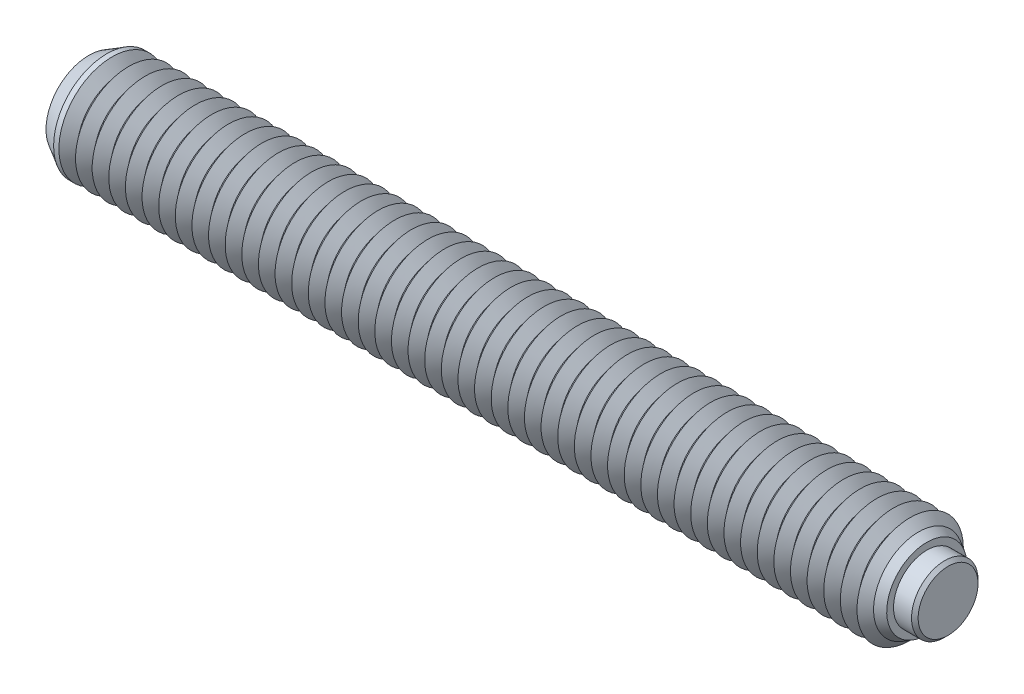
ISO-10303-21;
HEADER;
FILE_DESCRIPTION(('STEP AP214'),'2;1');
FILE_NAME('part.step','',(''),(''),'','','');
FILE_SCHEMA(('AUTOMOTIVE_DESIGN { 1 0 10303 214 1 1 1 1 }'));
ENDSEC;
DATA;
#1=APPLICATION_CONTEXT('core data for automotive mechanical design processes');
#2=APPLICATION_PROTOCOL_DEFINITION('international standard','automotive_design',2000,#1);
#3=PRODUCT_CONTEXT('',#1,'mechanical');
#4=PRODUCT('Part','Part','',(#3));
#5=PRODUCT_RELATED_PRODUCT_CATEGORY('part','',(#4));
#6=PRODUCT_DEFINITION_FORMATION('','',#4);
#7=PRODUCT_DEFINITION_CONTEXT('part definition',#1,'design');
#8=PRODUCT_DEFINITION('design','',#6,#7);
#9=PRODUCT_DEFINITION_SHAPE('','',#8);
#10=(LENGTH_UNIT() NAMED_UNIT(*) SI_UNIT(.MILLI.,.METRE.));
#11=(NAMED_UNIT(*) PLANE_ANGLE_UNIT() SI_UNIT($,.RADIAN.));
#12=(NAMED_UNIT(*) SI_UNIT($,.STERADIAN.) SOLID_ANGLE_UNIT());
#13=UNCERTAINTY_MEASURE_WITH_UNIT(LENGTH_MEASURE(1.E-05),#10,'distance_accuracy_value','');
#14=(GEOMETRIC_REPRESENTATION_CONTEXT(3) GLOBAL_UNCERTAINTY_ASSIGNED_CONTEXT((#13)) GLOBAL_UNIT_ASSIGNED_CONTEXT((#10,
#11,#12)) REPRESENTATION_CONTEXT('',''));
#15=CARTESIAN_POINT('',(0.,0.,0.));
#16=DIRECTION('',(0.,0.,1.));
#17=DIRECTION('',(1.,0.,0.));
#18=AXIS2_PLACEMENT_3D('',#15,#16,#17);
#19=CARTESIAN_POINT('',(2.225,0.,0.));
#20=DIRECTION('',(-1.,0.,0.));
#21=DIRECTION('',(0.,0.,1.));
#22=AXIS2_PLACEMENT_3D('',#19,#20,#21);
#23=CYLINDRICAL_SURFACE('',#22,2.5);
#24=CARTESIAN_POINT('',(1.975,0.,0.));
#25=DIRECTION('',(1.,0.,0.));
#26=DIRECTION('',(0.,0.,-1.));
#27=AXIS2_PLACEMENT_3D('',#24,#25,#26);
#28=CIRCLE('',#27,2.5);
#29=CARTESIAN_POINT('',(1.975,0.,-2.5));
#30=VERTEX_POINT('',#29);
#31=EDGE_CURVE('P0_E10',#30,#30,#28,.F.);
#32=ORIENTED_EDGE('',*,*,#31,.T.);
#33=EDGE_LOOP('',(#32));
#34=FACE_BOUND('',#33,.T.);
#35=CARTESIAN_POINT('',(-0.975,0.,0.));
#36=DIRECTION('',(1.,0.,0.));
#37=DIRECTION('',(0.,0.,-1.));
#38=AXIS2_PLACEMENT_3D('',#35,#36,#37);
#39=CIRCLE('',#38,2.5);
#40=CARTESIAN_POINT('',(-0.975,0.,-2.5));
#41=VERTEX_POINT('',#40);
#42=EDGE_CURVE('P0_E25',#41,#41,#39,.T.);
#43=ORIENTED_EDGE('',*,*,#42,.T.);
#44=EDGE_LOOP('',(#43));
#45=FACE_BOUND('',#44,.T.);
#46=ADVANCED_FACE('P0_F14',(#34,#45),#23,.T.);
#47=CARTESIAN_POINT('',(2.225,0.,0.));
#48=DIRECTION('',(1.,0.,0.));
#49=DIRECTION('',(0.,0.,-1.));
#50=AXIS2_PLACEMENT_3D('',#47,#48,#49);
#51=PLANE('',#50);
#52=CARTESIAN_POINT('',(2.225,0.,0.));
#53=DIRECTION('',(1.,0.,0.));
#54=DIRECTION('',(0.,0.,-1.));
#55=AXIS2_PLACEMENT_3D('',#52,#53,#54);
#56=CIRCLE('',#55,2.25);
#57=CARTESIAN_POINT('',(2.225,0.,-2.25));
#58=VERTEX_POINT('',#57);
#59=EDGE_CURVE('P0_E21',#58,#58,#56,.T.);
#60=ORIENTED_EDGE('',*,*,#59,.T.);
#61=EDGE_LOOP('',(#60));
#62=FACE_BOUND('',#61,.T.);
#63=ADVANCED_FACE('P0_F35',(#62),#51,.T.);
#64=CARTESIAN_POINT('',(-0.975,0.,0.));
#65=DIRECTION('',(1.,0.,0.));
#66=DIRECTION('',(0.,0.,-1.));
#67=AXIS2_PLACEMENT_3D('',#64,#65,#66);
#68=PLANE('',#67);
#69=ORIENTED_EDGE('',*,*,#42,.F.);
#70=EDGE_LOOP('',(#69));
#71=FACE_BOUND('',#70,.T.);
#72=ADVANCED_FACE('P0_F33',(#71),#68,.F.);
#73=CARTESIAN_POINT('',(2.225,0.,0.));
#74=DIRECTION('',(-1.,0.,0.));
#75=DIRECTION('',(0.,0.,1.));
#76=AXIS2_PLACEMENT_3D('',#73,#74,#75);
#77=CONICAL_SURFACE('',#76,2.25,0.785398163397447);
#78=ORIENTED_EDGE('',*,*,#31,.F.);
#79=EDGE_LOOP('',(#78));
#80=FACE_BOUND('',#79,.T.);
#81=ORIENTED_EDGE('',*,*,#59,.F.);
#82=EDGE_LOOP('',(#81));
#83=FACE_BOUND('',#82,.T.);
#84=ADVANCED_FACE('P0_F16',(#80,#83),#77,.T.);
#85=CLOSED_SHELL('',(#46,#63,#72,#84));
#86=MANIFOLD_SOLID_BREP('P0_B1',#85);
#87=CARTESIAN_POINT('',(-62.375,0.,0.));
#88=DIRECTION('',(1.,0.,0.));
#89=DIRECTION('',(0.,0.,-1.));
#90=AXIS2_PLACEMENT_3D('',#87,#88,#89);
#91=CYLINDRICAL_SURFACE('',#90,4.);
#92=CARTESIAN_POINT('',(-60.625,0.,0.));
#93=DIRECTION('',(1.,0.,0.));
#94=DIRECTION('',(0.,0.,-1.));
#95=AXIS2_PLACEMENT_3D('',#92,#93,#94);
#96=CIRCLE('',#95,4.);
#97=CARTESIAN_POINT('',(-60.625,0.,-4.));
#98=VERTEX_POINT('',#97);
#99=EDGE_CURVE('P1_E226',#98,#98,#96,.T.);
#100=ORIENTED_EDGE('',*,*,#99,.F.);
#101=EDGE_LOOP('',(#100));
#102=FACE_BOUND('',#101,.T.);
#103=CARTESIAN_POINT('',(-61.022918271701,0.,0.));
#104=DIRECTION('',(1.,0.,0.));
#105=DIRECTION('',(0.,0.,-1.));
#106=AXIS2_PLACEMENT_3D('',#103,#104,#105);
#107=CIRCLE('',#106,4.);
#108=CARTESIAN_POINT('',(-61.022918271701,0.,-4.));
#109=VERTEX_POINT('',#108);
#110=EDGE_CURVE('P1_E229',#109,#109,#107,.T.);
#111=ORIENTED_EDGE('',*,*,#110,.T.);
#112=EDGE_LOOP('',(#111));
#113=FACE_BOUND('',#112,.T.);
#114=ADVANCED_FACE('P1_F15',(#102,#113),#91,.T.);
#115=CARTESIAN_POINT('',(-1.25,0.,0.));
#116=DIRECTION('',(1.,0.,0.));
#117=DIRECTION('',(0.,0.,-1.));
#118=AXIS2_PLACEMENT_3D('',#115,#116,#117);
#119=CONICAL_SURFACE('',#118,3.2193752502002,0.895664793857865);
#120=CARTESIAN_POINT('',(-0.625000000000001,0.,0.));
#121=DIRECTION('',(1.,0.,0.));
#122=DIRECTION('',(0.,0.,-1.));
#123=AXIS2_PLACEMENT_3D('',#120,#121,#122);
#124=CIRCLE('',#123,4.);
#125=CARTESIAN_POINT('',(-0.625000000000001,0.,-4.));
#126=VERTEX_POINT('',#125);
#127=EDGE_CURVE('P1_E284',#126,#126,#124,.T.);
#128=ORIENTED_EDGE('',*,*,#127,.F.);
#129=EDGE_LOOP('',(#128));
#130=FACE_BOUND('',#129,.T.);
#131=CARTESIAN_POINT('',(-1.25,0.,0.));
#132=DIRECTION('',(1.,0.,0.));
#133=DIRECTION('',(0.,0.,-1.));
#134=AXIS2_PLACEMENT_3D('',#131,#132,#133);
#135=CIRCLE('',#134,3.2193752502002);
#136=CARTESIAN_POINT('',(-1.25,0.,-3.2193752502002));
#137=VERTEX_POINT('',#136);
#138=EDGE_CURVE('P1_E289',#137,#137,#135,.T.);
#139=ORIENTED_EDGE('',*,*,#138,.T.);
#140=EDGE_LOOP('',(#139));
#141=FACE_BOUND('',#140,.T.);
#142=ADVANCED_FACE('P1_F214',(#130,#141),#119,.T.);
#143=CARTESIAN_POINT('',(-1.875,0.,0.));
#144=DIRECTION('',(-1.,0.,0.));
#145=DIRECTION('',(0.,0.,1.));
#146=AXIS2_PLACEMENT_3D('',#143,#144,#145);
#147=CONICAL_SURFACE('',#146,4.,0.895664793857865);
#148=ORIENTED_EDGE('',*,*,#138,.F.);
#149=EDGE_LOOP('',(#148));
#150=FACE_BOUND('',#149,.T.);
#151=CARTESIAN_POINT('',(-1.875,0.,0.));
#152=DIRECTION('',(1.,0.,0.));
#153=DIRECTION('',(0.,0.,-1.));
#154=AXIS2_PLACEMENT_3D('',#151,#152,#153);
#155=CIRCLE('',#154,4.);
#156=CARTESIAN_POINT('',(-1.875,0.,-4.));
#157=VERTEX_POINT('',#156);
#158=EDGE_CURVE('P1_E292',#157,#157,#155,.T.);
#159=ORIENTED_EDGE('',*,*,#158,.T.);
#160=EDGE_LOOP('',(#159));
#161=FACE_BOUND('',#160,.T.);
#162=ADVANCED_FACE('P1_F220',(#150,#161),#147,.T.);
#163=CARTESIAN_POINT('',(-0.975,0.,0.));
#164=DIRECTION('',(1.,0.,0.));
#165=DIRECTION('',(0.,1.,0.));
#166=AXIS2_PLACEMENT_3D('',#163,#164,#165);
#167=PLANE('',#166);
#168=CARTESIAN_POINT('',(-0.975,0.,0.));
#169=DIRECTION('',(1.,0.,0.));
#170=DIRECTION('',(0.,1.,0.));
#171=AXIS2_PLACEMENT_3D('',#168,#169,#170);
#172=CIRCLE('',#171,2.5);
#173=CARTESIAN_POINT('',(-0.975,2.5,0.));
#174=VERTEX_POINT('',#173);
#175=EDGE_CURVE('P1_E279',#174,#174,#172,.T.);
#176=ORIENTED_EDGE('',*,*,#175,.T.);
#177=EDGE_LOOP('',(#176));
#178=FACE_BOUND('',#177,.T.);
#179=ADVANCED_FACE('P1_F955',(#178),#167,.T.);
#180=CARTESIAN_POINT('',(-0.975,0.,0.));
#181=DIRECTION('',(1.,0.,0.));
#182=DIRECTION('',(0.,1.,0.));
#183=AXIS2_PLACEMENT_3D('',#180,#181,#182);
#184=CYLINDRICAL_SURFACE('',#183,2.5);
#185=ORIENTED_EDGE('',*,*,#175,.F.);
#186=EDGE_LOOP('',(#185));
#187=FACE_BOUND('',#186,.T.);
#188=CARTESIAN_POINT('',(0.625,0.,0.));
#189=DIRECTION('',(1.,0.,0.));
#190=DIRECTION('',(0.,1.,0.));
#191=AXIS2_PLACEMENT_3D('',#188,#189,#190);
#192=CIRCLE('',#191,2.5);
#193=CARTESIAN_POINT('',(0.625,2.5,0.));
#194=VERTEX_POINT('',#193);
#195=EDGE_CURVE('P1_E281',#194,#194,#192,.T.);
#196=ORIENTED_EDGE('',*,*,#195,.T.);
#197=EDGE_LOOP('',(#196));
#198=FACE_BOUND('',#197,.T.);
#199=ADVANCED_FACE('P1_F210',(#187,#198),#184,.F.);
#200=CARTESIAN_POINT('',(0.625,3.01415608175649,0.));
#201=DIRECTION('',(1.,0.,0.));
#202=DIRECTION('',(0.,1.,0.));
#203=AXIS2_PLACEMENT_3D('',#200,#201,#202);
#204=PLANE('',#203);
#205=ORIENTED_EDGE('',*,*,#195,.F.);
#206=EDGE_LOOP('',(#205));
#207=FACE_BOUND('',#206,.T.);
#208=CARTESIAN_POINT('',(0.625,0.,0.));
#209=DIRECTION('',(1.,0.,0.));
#210=DIRECTION('',(0.,1.,0.));
#211=AXIS2_PLACEMENT_3D('',#208,#209,#210);
#212=CIRCLE('',#211,3.01415608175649);
#213=CARTESIAN_POINT('',(0.625,3.01415608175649,0.));
#214=VERTEX_POINT('',#213);
#215=EDGE_CURVE('P1_E121',#214,#214,#212,.T.);
#216=ORIENTED_EDGE('',*,*,#215,.T.);
#217=EDGE_LOOP('',(#216));
#218=FACE_BOUND('',#217,.T.);
#219=ADVANCED_FACE('P1_F206',(#207,#218),#204,.T.);
#220=CARTESIAN_POINT('',(0.625,0.,0.));
#221=DIRECTION('',(-1.,0.,0.));
#222=DIRECTION('',(0.,-1.,0.));
#223=AXIS2_PLACEMENT_3D('',#220,#221,#222);
#224=CONICAL_SURFACE('',#223,3.01415608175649,0.523598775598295);
#225=CARTESIAN_POINT('',(0.,0.,0.));
#226=DIRECTION('',(1.,0.,0.));
#227=DIRECTION('',(0.,0.,-1.));
#228=AXIS2_PLACEMENT_3D('',#225,#226,#227);
#229=CIRCLE('',#228,3.375);
#230=CARTESIAN_POINT('',(0.,0.,-3.375));
#231=VERTEX_POINT('',#230);
#232=EDGE_CURVE('P1_E236',#231,#231,#229,.T.);
#233=ORIENTED_EDGE('',*,*,#232,.T.);
#234=EDGE_LOOP('',(#233));
#235=FACE_BOUND('',#234,.T.);
#236=ORIENTED_EDGE('',*,*,#215,.F.);
#237=EDGE_LOOP('',(#236));
#238=FACE_BOUND('',#237,.T.);
#239=ADVANCED_FACE('P1_F203',(#235,#238),#224,.T.);
#240=CARTESIAN_POINT('',(0.,0.,0.));
#241=DIRECTION('',(-1.,0.,0.));
#242=DIRECTION('',(0.,0.,1.));
#243=AXIS2_PLACEMENT_3D('',#240,#241,#242);
#244=CONICAL_SURFACE('',#243,3.375,0.785398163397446);
#245=ORIENTED_EDGE('',*,*,#127,.T.);
#246=EDGE_LOOP('',(#245));
#247=FACE_BOUND('',#246,.T.);
#248=ORIENTED_EDGE('',*,*,#232,.F.);
#249=EDGE_LOOP('',(#248));
#250=FACE_BOUND('',#249,.T.);
#251=ADVANCED_FACE('P1_F17',(#247,#250),#244,.T.);
#252=CARTESIAN_POINT('',(-2.5,0.,0.));
#253=DIRECTION('',(1.,0.,0.));
#254=DIRECTION('',(0.,0.,-1.));
#255=AXIS2_PLACEMENT_3D('',#252,#253,#254);
#256=CONICAL_SURFACE('',#255,3.2193752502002,0.895664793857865);
#257=ORIENTED_EDGE('',*,*,#158,.F.);
#258=EDGE_LOOP('',(#257));
#259=FACE_BOUND('',#258,.T.);
#260=CARTESIAN_POINT('',(-2.5,0.,0.));
#261=DIRECTION('',(1.,0.,0.));
#262=DIRECTION('',(0.,0.,-1.));
#263=AXIS2_PLACEMENT_3D('',#260,#261,#262);
#264=CIRCLE('',#263,3.2193752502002);
#265=CARTESIAN_POINT('',(-2.5,0.,-3.2193752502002));
#266=VERTEX_POINT('',#265);
#267=EDGE_CURVE('P1_E295',#266,#266,#264,.T.);
#268=ORIENTED_EDGE('',*,*,#267,.T.);
#269=EDGE_LOOP('',(#268));
#270=FACE_BOUND('',#269,.T.);
#271=ADVANCED_FACE('P1_F949',(#259,#270),#256,.T.);
#272=CARTESIAN_POINT('',(-3.125,0.,0.));
#273=DIRECTION('',(-1.,0.,0.));
#274=DIRECTION('',(0.,0.,1.));
#275=AXIS2_PLACEMENT_3D('',#272,#273,#274);
#276=CONICAL_SURFACE('',#275,4.,0.895664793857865);
#277=ORIENTED_EDGE('',*,*,#267,.F.);
#278=EDGE_LOOP('',(#277));
#279=FACE_BOUND('',#278,.T.);
#280=CARTESIAN_POINT('',(-3.125,0.,0.));
#281=DIRECTION('',(1.,0.,0.));
#282=DIRECTION('',(0.,0.,-1.));
#283=AXIS2_PLACEMENT_3D('',#280,#281,#282);
#284=CIRCLE('',#283,4.);
#285=CARTESIAN_POINT('',(-3.125,0.,-4.));
#286=VERTEX_POINT('',#285);
#287=EDGE_CURVE('P1_E298',#286,#286,#284,.T.);
#288=ORIENTED_EDGE('',*,*,#287,.T.);
#289=EDGE_LOOP('',(#288));
#290=FACE_BOUND('',#289,.T.);
#291=ADVANCED_FACE('P1_F945',(#279,#290),#276,.T.);
#292=CARTESIAN_POINT('',(-3.75,0.,0.));
#293=DIRECTION('',(1.,0.,0.));
#294=DIRECTION('',(0.,0.,-1.));
#295=AXIS2_PLACEMENT_3D('',#292,#293,#294);
#296=CONICAL_SURFACE('',#295,3.2193752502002,0.895664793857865);
#297=ORIENTED_EDGE('',*,*,#287,.F.);
#298=EDGE_LOOP('',(#297));
#299=FACE_BOUND('',#298,.T.);
#300=CARTESIAN_POINT('',(-3.75,0.,0.));
#301=DIRECTION('',(1.,0.,0.));
#302=DIRECTION('',(0.,0.,-1.));
#303=AXIS2_PLACEMENT_3D('',#300,#301,#302);
#304=CIRCLE('',#303,3.2193752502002);
#305=CARTESIAN_POINT('',(-3.75,0.,-3.2193752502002));
#306=VERTEX_POINT('',#305);
#307=EDGE_CURVE('P1_E301',#306,#306,#304,.T.);
#308=ORIENTED_EDGE('',*,*,#307,.T.);
#309=EDGE_LOOP('',(#308));
#310=FACE_BOUND('',#309,.T.);
#311=ADVANCED_FACE('P1_F941',(#299,#310),#296,.T.);
#312=CARTESIAN_POINT('',(-4.375,0.,0.));
#313=DIRECTION('',(-1.,0.,0.));
#314=DIRECTION('',(0.,0.,1.));
#315=AXIS2_PLACEMENT_3D('',#312,#313,#314);
#316=CONICAL_SURFACE('',#315,4.,0.895664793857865);
#317=ORIENTED_EDGE('',*,*,#307,.F.);
#318=EDGE_LOOP('',(#317));
#319=FACE_BOUND('',#318,.T.);
#320=CARTESIAN_POINT('',(-4.375,0.,0.));
#321=DIRECTION('',(1.,0.,0.));
#322=DIRECTION('',(0.,0.,-1.));
#323=AXIS2_PLACEMENT_3D('',#320,#321,#322);
#324=CIRCLE('',#323,4.);
#325=CARTESIAN_POINT('',(-4.375,0.,-4.));
#326=VERTEX_POINT('',#325);
#327=EDGE_CURVE('P1_E304',#326,#326,#324,.T.);
#328=ORIENTED_EDGE('',*,*,#327,.T.);
#329=EDGE_LOOP('',(#328));
#330=FACE_BOUND('',#329,.T.);
#331=ADVANCED_FACE('P1_F937',(#319,#330),#316,.T.);
#332=CARTESIAN_POINT('',(-5.,0.,0.));
#333=DIRECTION('',(1.,0.,0.));
#334=DIRECTION('',(0.,0.,-1.));
#335=AXIS2_PLACEMENT_3D('',#332,#333,#334);
#336=CONICAL_SURFACE('',#335,3.2193752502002,0.895664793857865);
#337=ORIENTED_EDGE('',*,*,#327,.F.);
#338=EDGE_LOOP('',(#337));
#339=FACE_BOUND('',#338,.T.);
#340=CARTESIAN_POINT('',(-5.,0.,0.));
#341=DIRECTION('',(1.,0.,0.));
#342=DIRECTION('',(0.,0.,-1.));
#343=AXIS2_PLACEMENT_3D('',#340,#341,#342);
#344=CIRCLE('',#343,3.2193752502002);
#345=CARTESIAN_POINT('',(-5.,0.,-3.2193752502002));
#346=VERTEX_POINT('',#345);
#347=EDGE_CURVE('P1_E307',#346,#346,#344,.T.);
#348=ORIENTED_EDGE('',*,*,#347,.T.);
#349=EDGE_LOOP('',(#348));
#350=FACE_BOUND('',#349,.T.);
#351=ADVANCED_FACE('P1_F933',(#339,#350),#336,.T.);
#352=CARTESIAN_POINT('',(-5.625,0.,0.));
#353=DIRECTION('',(-1.,0.,0.));
#354=DIRECTION('',(0.,0.,1.));
#355=AXIS2_PLACEMENT_3D('',#352,#353,#354);
#356=CONICAL_SURFACE('',#355,4.,0.895664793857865);
#357=ORIENTED_EDGE('',*,*,#347,.F.);
#358=EDGE_LOOP('',(#357));
#359=FACE_BOUND('',#358,.T.);
#360=CARTESIAN_POINT('',(-5.625,0.,0.));
#361=DIRECTION('',(1.,0.,0.));
#362=DIRECTION('',(0.,0.,-1.));
#363=AXIS2_PLACEMENT_3D('',#360,#361,#362);
#364=CIRCLE('',#363,4.);
#365=CARTESIAN_POINT('',(-5.625,0.,-4.));
#366=VERTEX_POINT('',#365);
#367=EDGE_CURVE('P1_E310',#366,#366,#364,.T.);
#368=ORIENTED_EDGE('',*,*,#367,.T.);
#369=EDGE_LOOP('',(#368));
#370=FACE_BOUND('',#369,.T.);
#371=ADVANCED_FACE('P1_F929',(#359,#370),#356,.T.);
#372=CARTESIAN_POINT('',(-6.25,0.,0.));
#373=DIRECTION('',(1.,0.,0.));
#374=DIRECTION('',(0.,0.,-1.));
#375=AXIS2_PLACEMENT_3D('',#372,#373,#374);
#376=CONICAL_SURFACE('',#375,3.2193752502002,0.895664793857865);
#377=ORIENTED_EDGE('',*,*,#367,.F.);
#378=EDGE_LOOP('',(#377));
#379=FACE_BOUND('',#378,.T.);
#380=CARTESIAN_POINT('',(-6.25,0.,0.));
#381=DIRECTION('',(1.,0.,0.));
#382=DIRECTION('',(0.,0.,-1.));
#383=AXIS2_PLACEMENT_3D('',#380,#381,#382);
#384=CIRCLE('',#383,3.2193752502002);
#385=CARTESIAN_POINT('',(-6.25,0.,-3.2193752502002));
#386=VERTEX_POINT('',#385);
#387=EDGE_CURVE('P1_E313',#386,#386,#384,.T.);
#388=ORIENTED_EDGE('',*,*,#387,.T.);
#389=EDGE_LOOP('',(#388));
#390=FACE_BOUND('',#389,.T.);
#391=ADVANCED_FACE('P1_F925',(#379,#390),#376,.T.);
#392=CARTESIAN_POINT('',(-6.875,0.,0.));
#393=DIRECTION('',(-1.,0.,0.));
#394=DIRECTION('',(0.,0.,1.));
#395=AXIS2_PLACEMENT_3D('',#392,#393,#394);
#396=CONICAL_SURFACE('',#395,4.,0.895664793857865);
#397=ORIENTED_EDGE('',*,*,#387,.F.);
#398=EDGE_LOOP('',(#397));
#399=FACE_BOUND('',#398,.T.);
#400=CARTESIAN_POINT('',(-6.875,0.,0.));
#401=DIRECTION('',(1.,0.,0.));
#402=DIRECTION('',(0.,0.,-1.));
#403=AXIS2_PLACEMENT_3D('',#400,#401,#402);
#404=CIRCLE('',#403,4.);
#405=CARTESIAN_POINT('',(-6.875,0.,-4.));
#406=VERTEX_POINT('',#405);
#407=EDGE_CURVE('P1_E316',#406,#406,#404,.T.);
#408=ORIENTED_EDGE('',*,*,#407,.T.);
#409=EDGE_LOOP('',(#408));
#410=FACE_BOUND('',#409,.T.);
#411=ADVANCED_FACE('P1_F921',(#399,#410),#396,.T.);
#412=CARTESIAN_POINT('',(-7.5,0.,0.));
#413=DIRECTION('',(1.,0.,0.));
#414=DIRECTION('',(0.,0.,-1.));
#415=AXIS2_PLACEMENT_3D('',#412,#413,#414);
#416=CONICAL_SURFACE('',#415,3.2193752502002,0.895664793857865);
#417=ORIENTED_EDGE('',*,*,#407,.F.);
#418=EDGE_LOOP('',(#417));
#419=FACE_BOUND('',#418,.T.);
#420=CARTESIAN_POINT('',(-7.5,0.,0.));
#421=DIRECTION('',(1.,0.,0.));
#422=DIRECTION('',(0.,0.,-1.));
#423=AXIS2_PLACEMENT_3D('',#420,#421,#422);
#424=CIRCLE('',#423,3.2193752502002);
#425=CARTESIAN_POINT('',(-7.5,0.,-3.2193752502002));
#426=VERTEX_POINT('',#425);
#427=EDGE_CURVE('P1_E319',#426,#426,#424,.T.);
#428=ORIENTED_EDGE('',*,*,#427,.T.);
#429=EDGE_LOOP('',(#428));
#430=FACE_BOUND('',#429,.T.);
#431=ADVANCED_FACE('P1_F917',(#419,#430),#416,.T.);
#432=CARTESIAN_POINT('',(-8.125,0.,0.));
#433=DIRECTION('',(-1.,0.,0.));
#434=DIRECTION('',(0.,0.,1.));
#435=AXIS2_PLACEMENT_3D('',#432,#433,#434);
#436=CONICAL_SURFACE('',#435,4.,0.895664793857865);
#437=ORIENTED_EDGE('',*,*,#427,.F.);
#438=EDGE_LOOP('',(#437));
#439=FACE_BOUND('',#438,.T.);
#440=CARTESIAN_POINT('',(-8.125,0.,0.));
#441=DIRECTION('',(1.,0.,0.));
#442=DIRECTION('',(0.,0.,-1.));
#443=AXIS2_PLACEMENT_3D('',#440,#441,#442);
#444=CIRCLE('',#443,4.);
#445=CARTESIAN_POINT('',(-8.125,0.,-4.));
#446=VERTEX_POINT('',#445);
#447=EDGE_CURVE('P1_E322',#446,#446,#444,.T.);
#448=ORIENTED_EDGE('',*,*,#447,.T.);
#449=EDGE_LOOP('',(#448));
#450=FACE_BOUND('',#449,.T.);
#451=ADVANCED_FACE('P1_F913',(#439,#450),#436,.T.);
#452=CARTESIAN_POINT('',(-8.75,0.,0.));
#453=DIRECTION('',(1.,0.,0.));
#454=DIRECTION('',(0.,0.,-1.));
#455=AXIS2_PLACEMENT_3D('',#452,#453,#454);
#456=CONICAL_SURFACE('',#455,3.2193752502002,0.895664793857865);
#457=ORIENTED_EDGE('',*,*,#447,.F.);
#458=EDGE_LOOP('',(#457));
#459=FACE_BOUND('',#458,.T.);
#460=CARTESIAN_POINT('',(-8.75,0.,0.));
#461=DIRECTION('',(1.,0.,0.));
#462=DIRECTION('',(0.,0.,-1.));
#463=AXIS2_PLACEMENT_3D('',#460,#461,#462);
#464=CIRCLE('',#463,3.2193752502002);
#465=CARTESIAN_POINT('',(-8.75,0.,-3.2193752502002));
#466=VERTEX_POINT('',#465);
#467=EDGE_CURVE('P1_E325',#466,#466,#464,.T.);
#468=ORIENTED_EDGE('',*,*,#467,.T.);
#469=EDGE_LOOP('',(#468));
#470=FACE_BOUND('',#469,.T.);
#471=ADVANCED_FACE('P1_F909',(#459,#470),#456,.T.);
#472=CARTESIAN_POINT('',(-9.375,0.,0.));
#473=DIRECTION('',(-1.,0.,0.));
#474=DIRECTION('',(0.,0.,1.));
#475=AXIS2_PLACEMENT_3D('',#472,#473,#474);
#476=CONICAL_SURFACE('',#475,4.,0.895664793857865);
#477=ORIENTED_EDGE('',*,*,#467,.F.);
#478=EDGE_LOOP('',(#477));
#479=FACE_BOUND('',#478,.T.);
#480=CARTESIAN_POINT('',(-9.375,0.,0.));
#481=DIRECTION('',(1.,0.,0.));
#482=DIRECTION('',(0.,0.,-1.));
#483=AXIS2_PLACEMENT_3D('',#480,#481,#482);
#484=CIRCLE('',#483,4.);
#485=CARTESIAN_POINT('',(-9.375,0.,-4.));
#486=VERTEX_POINT('',#485);
#487=EDGE_CURVE('P1_E328',#486,#486,#484,.T.);
#488=ORIENTED_EDGE('',*,*,#487,.T.);
#489=EDGE_LOOP('',(#488));
#490=FACE_BOUND('',#489,.T.);
#491=ADVANCED_FACE('P1_F905',(#479,#490),#476,.T.);
#492=CARTESIAN_POINT('',(-10.,0.,0.));
#493=DIRECTION('',(1.,0.,0.));
#494=DIRECTION('',(0.,0.,-1.));
#495=AXIS2_PLACEMENT_3D('',#492,#493,#494);
#496=CONICAL_SURFACE('',#495,3.2193752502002,0.895664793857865);
#497=ORIENTED_EDGE('',*,*,#487,.F.);
#498=EDGE_LOOP('',(#497));
#499=FACE_BOUND('',#498,.T.);
#500=CARTESIAN_POINT('',(-10.,0.,0.));
#501=DIRECTION('',(1.,0.,0.));
#502=DIRECTION('',(0.,0.,-1.));
#503=AXIS2_PLACEMENT_3D('',#500,#501,#502);
#504=CIRCLE('',#503,3.2193752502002);
#505=CARTESIAN_POINT('',(-10.,0.,-3.2193752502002));
#506=VERTEX_POINT('',#505);
#507=EDGE_CURVE('P1_E331',#506,#506,#504,.T.);
#508=ORIENTED_EDGE('',*,*,#507,.T.);
#509=EDGE_LOOP('',(#508));
#510=FACE_BOUND('',#509,.T.);
#511=ADVANCED_FACE('P1_F901',(#499,#510),#496,.T.);
#512=CARTESIAN_POINT('',(-10.625,0.,0.));
#513=DIRECTION('',(-1.,0.,0.));
#514=DIRECTION('',(0.,0.,1.));
#515=AXIS2_PLACEMENT_3D('',#512,#513,#514);
#516=CONICAL_SURFACE('',#515,4.,0.895664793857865);
#517=ORIENTED_EDGE('',*,*,#507,.F.);
#518=EDGE_LOOP('',(#517));
#519=FACE_BOUND('',#518,.T.);
#520=CARTESIAN_POINT('',(-10.625,0.,0.));
#521=DIRECTION('',(1.,0.,0.));
#522=DIRECTION('',(0.,0.,-1.));
#523=AXIS2_PLACEMENT_3D('',#520,#521,#522);
#524=CIRCLE('',#523,4.);
#525=CARTESIAN_POINT('',(-10.625,0.,-4.));
#526=VERTEX_POINT('',#525);
#527=EDGE_CURVE('P1_E334',#526,#526,#524,.T.);
#528=ORIENTED_EDGE('',*,*,#527,.T.);
#529=EDGE_LOOP('',(#528));
#530=FACE_BOUND('',#529,.T.);
#531=ADVANCED_FACE('P1_F897',(#519,#530),#516,.T.);
#532=CARTESIAN_POINT('',(-11.25,0.,0.));
#533=DIRECTION('',(1.,0.,0.));
#534=DIRECTION('',(0.,0.,-1.));
#535=AXIS2_PLACEMENT_3D('',#532,#533,#534);
#536=CONICAL_SURFACE('',#535,3.2193752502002,0.895664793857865);
#537=ORIENTED_EDGE('',*,*,#527,.F.);
#538=EDGE_LOOP('',(#537));
#539=FACE_BOUND('',#538,.T.);
#540=CARTESIAN_POINT('',(-11.25,0.,0.));
#541=DIRECTION('',(1.,0.,0.));
#542=DIRECTION('',(0.,0.,-1.));
#543=AXIS2_PLACEMENT_3D('',#540,#541,#542);
#544=CIRCLE('',#543,3.2193752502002);
#545=CARTESIAN_POINT('',(-11.25,0.,-3.2193752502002));
#546=VERTEX_POINT('',#545);
#547=EDGE_CURVE('P1_E337',#546,#546,#544,.T.);
#548=ORIENTED_EDGE('',*,*,#547,.T.);
#549=EDGE_LOOP('',(#548));
#550=FACE_BOUND('',#549,.T.);
#551=ADVANCED_FACE('P1_F893',(#539,#550),#536,.T.);
#552=CARTESIAN_POINT('',(-11.875,0.,0.));
#553=DIRECTION('',(-1.,0.,0.));
#554=DIRECTION('',(0.,0.,1.));
#555=AXIS2_PLACEMENT_3D('',#552,#553,#554);
#556=CONICAL_SURFACE('',#555,4.,0.895664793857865);
#557=ORIENTED_EDGE('',*,*,#547,.F.);
#558=EDGE_LOOP('',(#557));
#559=FACE_BOUND('',#558,.T.);
#560=CARTESIAN_POINT('',(-11.875,0.,0.));
#561=DIRECTION('',(1.,0.,0.));
#562=DIRECTION('',(0.,0.,-1.));
#563=AXIS2_PLACEMENT_3D('',#560,#561,#562);
#564=CIRCLE('',#563,4.);
#565=CARTESIAN_POINT('',(-11.875,0.,-4.));
#566=VERTEX_POINT('',#565);
#567=EDGE_CURVE('P1_E340',#566,#566,#564,.T.);
#568=ORIENTED_EDGE('',*,*,#567,.T.);
#569=EDGE_LOOP('',(#568));
#570=FACE_BOUND('',#569,.T.);
#571=ADVANCED_FACE('P1_F889',(#559,#570),#556,.T.);
#572=CARTESIAN_POINT('',(-12.5,0.,0.));
#573=DIRECTION('',(1.,0.,0.));
#574=DIRECTION('',(0.,0.,-1.));
#575=AXIS2_PLACEMENT_3D('',#572,#573,#574);
#576=CONICAL_SURFACE('',#575,3.2193752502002,0.895664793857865);
#577=ORIENTED_EDGE('',*,*,#567,.F.);
#578=EDGE_LOOP('',(#577));
#579=FACE_BOUND('',#578,.T.);
#580=CARTESIAN_POINT('',(-12.5,0.,0.));
#581=DIRECTION('',(1.,0.,0.));
#582=DIRECTION('',(0.,0.,-1.));
#583=AXIS2_PLACEMENT_3D('',#580,#581,#582);
#584=CIRCLE('',#583,3.2193752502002);
#585=CARTESIAN_POINT('',(-12.5,0.,-3.2193752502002));
#586=VERTEX_POINT('',#585);
#587=EDGE_CURVE('P1_E343',#586,#586,#584,.T.);
#588=ORIENTED_EDGE('',*,*,#587,.T.);
#589=EDGE_LOOP('',(#588));
#590=FACE_BOUND('',#589,.T.);
#591=ADVANCED_FACE('P1_F885',(#579,#590),#576,.T.);
#592=CARTESIAN_POINT('',(-13.125,0.,0.));
#593=DIRECTION('',(-1.,0.,0.));
#594=DIRECTION('',(0.,0.,1.));
#595=AXIS2_PLACEMENT_3D('',#592,#593,#594);
#596=CONICAL_SURFACE('',#595,4.,0.895664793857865);
#597=ORIENTED_EDGE('',*,*,#587,.F.);
#598=EDGE_LOOP('',(#597));
#599=FACE_BOUND('',#598,.T.);
#600=CARTESIAN_POINT('',(-13.125,0.,0.));
#601=DIRECTION('',(1.,0.,0.));
#602=DIRECTION('',(0.,0.,-1.));
#603=AXIS2_PLACEMENT_3D('',#600,#601,#602);
#604=CIRCLE('',#603,4.);
#605=CARTESIAN_POINT('',(-13.125,0.,-4.));
#606=VERTEX_POINT('',#605);
#607=EDGE_CURVE('P1_E346',#606,#606,#604,.T.);
#608=ORIENTED_EDGE('',*,*,#607,.T.);
#609=EDGE_LOOP('',(#608));
#610=FACE_BOUND('',#609,.T.);
#611=ADVANCED_FACE('P1_F881',(#599,#610),#596,.T.);
#612=CARTESIAN_POINT('',(-13.75,0.,0.));
#613=DIRECTION('',(1.,0.,0.));
#614=DIRECTION('',(0.,0.,-1.));
#615=AXIS2_PLACEMENT_3D('',#612,#613,#614);
#616=CONICAL_SURFACE('',#615,3.2193752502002,0.895664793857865);
#617=ORIENTED_EDGE('',*,*,#607,.F.);
#618=EDGE_LOOP('',(#617));
#619=FACE_BOUND('',#618,.T.);
#620=CARTESIAN_POINT('',(-13.75,0.,0.));
#621=DIRECTION('',(1.,0.,0.));
#622=DIRECTION('',(0.,0.,-1.));
#623=AXIS2_PLACEMENT_3D('',#620,#621,#622);
#624=CIRCLE('',#623,3.2193752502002);
#625=CARTESIAN_POINT('',(-13.75,0.,-3.2193752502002));
#626=VERTEX_POINT('',#625);
#627=EDGE_CURVE('P1_E349',#626,#626,#624,.T.);
#628=ORIENTED_EDGE('',*,*,#627,.T.);
#629=EDGE_LOOP('',(#628));
#630=FACE_BOUND('',#629,.T.);
#631=ADVANCED_FACE('P1_F877',(#619,#630),#616,.T.);
#632=CARTESIAN_POINT('',(-14.375,0.,0.));
#633=DIRECTION('',(-1.,0.,0.));
#634=DIRECTION('',(0.,0.,1.));
#635=AXIS2_PLACEMENT_3D('',#632,#633,#634);
#636=CONICAL_SURFACE('',#635,4.,0.895664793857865);
#637=ORIENTED_EDGE('',*,*,#627,.F.);
#638=EDGE_LOOP('',(#637));
#639=FACE_BOUND('',#638,.T.);
#640=CARTESIAN_POINT('',(-14.375,0.,0.));
#641=DIRECTION('',(1.,0.,0.));
#642=DIRECTION('',(0.,0.,-1.));
#643=AXIS2_PLACEMENT_3D('',#640,#641,#642);
#644=CIRCLE('',#643,4.);
#645=CARTESIAN_POINT('',(-14.375,0.,-4.));
#646=VERTEX_POINT('',#645);
#647=EDGE_CURVE('P1_E352',#646,#646,#644,.T.);
#648=ORIENTED_EDGE('',*,*,#647,.T.);
#649=EDGE_LOOP('',(#648));
#650=FACE_BOUND('',#649,.T.);
#651=ADVANCED_FACE('P1_F873',(#639,#650),#636,.T.);
#652=CARTESIAN_POINT('',(-15.,0.,0.));
#653=DIRECTION('',(1.,0.,0.));
#654=DIRECTION('',(0.,0.,-1.));
#655=AXIS2_PLACEMENT_3D('',#652,#653,#654);
#656=CONICAL_SURFACE('',#655,3.2193752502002,0.895664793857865);
#657=ORIENTED_EDGE('',*,*,#647,.F.);
#658=EDGE_LOOP('',(#657));
#659=FACE_BOUND('',#658,.T.);
#660=CARTESIAN_POINT('',(-15.,0.,0.));
#661=DIRECTION('',(1.,0.,0.));
#662=DIRECTION('',(0.,0.,-1.));
#663=AXIS2_PLACEMENT_3D('',#660,#661,#662);
#664=CIRCLE('',#663,3.2193752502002);
#665=CARTESIAN_POINT('',(-15.,0.,-3.2193752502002));
#666=VERTEX_POINT('',#665);
#667=EDGE_CURVE('P1_E355',#666,#666,#664,.T.);
#668=ORIENTED_EDGE('',*,*,#667,.T.);
#669=EDGE_LOOP('',(#668));
#670=FACE_BOUND('',#669,.T.);
#671=ADVANCED_FACE('P1_F869',(#659,#670),#656,.T.);
#672=CARTESIAN_POINT('',(-15.625,0.,0.));
#673=DIRECTION('',(-1.,0.,0.));
#674=DIRECTION('',(0.,0.,1.));
#675=AXIS2_PLACEMENT_3D('',#672,#673,#674);
#676=CONICAL_SURFACE('',#675,4.,0.895664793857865);
#677=ORIENTED_EDGE('',*,*,#667,.F.);
#678=EDGE_LOOP('',(#677));
#679=FACE_BOUND('',#678,.T.);
#680=CARTESIAN_POINT('',(-15.625,0.,0.));
#681=DIRECTION('',(1.,0.,0.));
#682=DIRECTION('',(0.,0.,-1.));
#683=AXIS2_PLACEMENT_3D('',#680,#681,#682);
#684=CIRCLE('',#683,4.);
#685=CARTESIAN_POINT('',(-15.625,0.,-4.));
#686=VERTEX_POINT('',#685);
#687=EDGE_CURVE('P1_E358',#686,#686,#684,.T.);
#688=ORIENTED_EDGE('',*,*,#687,.T.);
#689=EDGE_LOOP('',(#688));
#690=FACE_BOUND('',#689,.T.);
#691=ADVANCED_FACE('P1_F865',(#679,#690),#676,.T.);
#692=CARTESIAN_POINT('',(-16.25,0.,0.));
#693=DIRECTION('',(1.,0.,0.));
#694=DIRECTION('',(0.,0.,-1.));
#695=AXIS2_PLACEMENT_3D('',#692,#693,#694);
#696=CONICAL_SURFACE('',#695,3.2193752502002,0.895664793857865);
#697=ORIENTED_EDGE('',*,*,#687,.F.);
#698=EDGE_LOOP('',(#697));
#699=FACE_BOUND('',#698,.T.);
#700=CARTESIAN_POINT('',(-16.25,0.,0.));
#701=DIRECTION('',(1.,0.,0.));
#702=DIRECTION('',(0.,0.,-1.));
#703=AXIS2_PLACEMENT_3D('',#700,#701,#702);
#704=CIRCLE('',#703,3.2193752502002);
#705=CARTESIAN_POINT('',(-16.25,0.,-3.2193752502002));
#706=VERTEX_POINT('',#705);
#707=EDGE_CURVE('P1_E361',#706,#706,#704,.T.);
#708=ORIENTED_EDGE('',*,*,#707,.T.);
#709=EDGE_LOOP('',(#708));
#710=FACE_BOUND('',#709,.T.);
#711=ADVANCED_FACE('P1_F861',(#699,#710),#696,.T.);
#712=CARTESIAN_POINT('',(-16.875,0.,0.));
#713=DIRECTION('',(-1.,0.,0.));
#714=DIRECTION('',(0.,0.,1.));
#715=AXIS2_PLACEMENT_3D('',#712,#713,#714);
#716=CONICAL_SURFACE('',#715,4.,0.895664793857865);
#717=ORIENTED_EDGE('',*,*,#707,.F.);
#718=EDGE_LOOP('',(#717));
#719=FACE_BOUND('',#718,.T.);
#720=CARTESIAN_POINT('',(-16.875,0.,0.));
#721=DIRECTION('',(1.,0.,0.));
#722=DIRECTION('',(0.,0.,-1.));
#723=AXIS2_PLACEMENT_3D('',#720,#721,#722);
#724=CIRCLE('',#723,4.);
#725=CARTESIAN_POINT('',(-16.875,0.,-4.));
#726=VERTEX_POINT('',#725);
#727=EDGE_CURVE('P1_E364',#726,#726,#724,.T.);
#728=ORIENTED_EDGE('',*,*,#727,.T.);
#729=EDGE_LOOP('',(#728));
#730=FACE_BOUND('',#729,.T.);
#731=ADVANCED_FACE('P1_F857',(#719,#730),#716,.T.);
#732=CARTESIAN_POINT('',(-17.5,0.,0.));
#733=DIRECTION('',(1.,0.,0.));
#734=DIRECTION('',(0.,0.,-1.));
#735=AXIS2_PLACEMENT_3D('',#732,#733,#734);
#736=CONICAL_SURFACE('',#735,3.2193752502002,0.895664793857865);
#737=ORIENTED_EDGE('',*,*,#727,.F.);
#738=EDGE_LOOP('',(#737));
#739=FACE_BOUND('',#738,.T.);
#740=CARTESIAN_POINT('',(-17.5,0.,0.));
#741=DIRECTION('',(1.,0.,0.));
#742=DIRECTION('',(0.,0.,-1.));
#743=AXIS2_PLACEMENT_3D('',#740,#741,#742);
#744=CIRCLE('',#743,3.2193752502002);
#745=CARTESIAN_POINT('',(-17.5,0.,-3.2193752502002));
#746=VERTEX_POINT('',#745);
#747=EDGE_CURVE('P1_E367',#746,#746,#744,.T.);
#748=ORIENTED_EDGE('',*,*,#747,.T.);
#749=EDGE_LOOP('',(#748));
#750=FACE_BOUND('',#749,.T.);
#751=ADVANCED_FACE('P1_F853',(#739,#750),#736,.T.);
#752=CARTESIAN_POINT('',(-18.125,0.,0.));
#753=DIRECTION('',(-1.,0.,0.));
#754=DIRECTION('',(0.,0.,1.));
#755=AXIS2_PLACEMENT_3D('',#752,#753,#754);
#756=CONICAL_SURFACE('',#755,4.,0.895664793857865);
#757=ORIENTED_EDGE('',*,*,#747,.F.);
#758=EDGE_LOOP('',(#757));
#759=FACE_BOUND('',#758,.T.);
#760=CARTESIAN_POINT('',(-18.125,0.,0.));
#761=DIRECTION('',(1.,0.,0.));
#762=DIRECTION('',(0.,0.,-1.));
#763=AXIS2_PLACEMENT_3D('',#760,#761,#762);
#764=CIRCLE('',#763,4.);
#765=CARTESIAN_POINT('',(-18.125,0.,-4.));
#766=VERTEX_POINT('',#765);
#767=EDGE_CURVE('P1_E370',#766,#766,#764,.T.);
#768=ORIENTED_EDGE('',*,*,#767,.T.);
#769=EDGE_LOOP('',(#768));
#770=FACE_BOUND('',#769,.T.);
#771=ADVANCED_FACE('P1_F849',(#759,#770),#756,.T.);
#772=CARTESIAN_POINT('',(-18.75,0.,0.));
#773=DIRECTION('',(1.,0.,0.));
#774=DIRECTION('',(0.,0.,-1.));
#775=AXIS2_PLACEMENT_3D('',#772,#773,#774);
#776=CONICAL_SURFACE('',#775,3.2193752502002,0.895664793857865);
#777=ORIENTED_EDGE('',*,*,#767,.F.);
#778=EDGE_LOOP('',(#777));
#779=FACE_BOUND('',#778,.T.);
#780=CARTESIAN_POINT('',(-18.75,0.,0.));
#781=DIRECTION('',(1.,0.,0.));
#782=DIRECTION('',(0.,0.,-1.));
#783=AXIS2_PLACEMENT_3D('',#780,#781,#782);
#784=CIRCLE('',#783,3.2193752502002);
#785=CARTESIAN_POINT('',(-18.75,0.,-3.2193752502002));
#786=VERTEX_POINT('',#785);
#787=EDGE_CURVE('P1_E373',#786,#786,#784,.T.);
#788=ORIENTED_EDGE('',*,*,#787,.T.);
#789=EDGE_LOOP('',(#788));
#790=FACE_BOUND('',#789,.T.);
#791=ADVANCED_FACE('P1_F845',(#779,#790),#776,.T.);
#792=CARTESIAN_POINT('',(-19.375,0.,0.));
#793=DIRECTION('',(-1.,0.,0.));
#794=DIRECTION('',(0.,0.,1.));
#795=AXIS2_PLACEMENT_3D('',#792,#793,#794);
#796=CONICAL_SURFACE('',#795,4.,0.895664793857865);
#797=ORIENTED_EDGE('',*,*,#787,.F.);
#798=EDGE_LOOP('',(#797));
#799=FACE_BOUND('',#798,.T.);
#800=CARTESIAN_POINT('',(-19.375,0.,0.));
#801=DIRECTION('',(1.,0.,0.));
#802=DIRECTION('',(0.,0.,-1.));
#803=AXIS2_PLACEMENT_3D('',#800,#801,#802);
#804=CIRCLE('',#803,4.);
#805=CARTESIAN_POINT('',(-19.375,0.,-4.));
#806=VERTEX_POINT('',#805);
#807=EDGE_CURVE('P1_E376',#806,#806,#804,.T.);
#808=ORIENTED_EDGE('',*,*,#807,.T.);
#809=EDGE_LOOP('',(#808));
#810=FACE_BOUND('',#809,.T.);
#811=ADVANCED_FACE('P1_F841',(#799,#810),#796,.T.);
#812=CARTESIAN_POINT('',(-20.,0.,0.));
#813=DIRECTION('',(1.,0.,0.));
#814=DIRECTION('',(0.,0.,-1.));
#815=AXIS2_PLACEMENT_3D('',#812,#813,#814);
#816=CONICAL_SURFACE('',#815,3.2193752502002,0.895664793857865);
#817=ORIENTED_EDGE('',*,*,#807,.F.);
#818=EDGE_LOOP('',(#817));
#819=FACE_BOUND('',#818,.T.);
#820=CARTESIAN_POINT('',(-20.,0.,0.));
#821=DIRECTION('',(1.,0.,0.));
#822=DIRECTION('',(0.,0.,-1.));
#823=AXIS2_PLACEMENT_3D('',#820,#821,#822);
#824=CIRCLE('',#823,3.2193752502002);
#825=CARTESIAN_POINT('',(-20.,0.,-3.2193752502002));
#826=VERTEX_POINT('',#825);
#827=EDGE_CURVE('P1_E379',#826,#826,#824,.T.);
#828=ORIENTED_EDGE('',*,*,#827,.T.);
#829=EDGE_LOOP('',(#828));
#830=FACE_BOUND('',#829,.T.);
#831=ADVANCED_FACE('P1_F837',(#819,#830),#816,.T.);
#832=CARTESIAN_POINT('',(-20.625,0.,0.));
#833=DIRECTION('',(-1.,0.,0.));
#834=DIRECTION('',(0.,0.,1.));
#835=AXIS2_PLACEMENT_3D('',#832,#833,#834);
#836=CONICAL_SURFACE('',#835,4.,0.895664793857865);
#837=ORIENTED_EDGE('',*,*,#827,.F.);
#838=EDGE_LOOP('',(#837));
#839=FACE_BOUND('',#838,.T.);
#840=CARTESIAN_POINT('',(-20.625,0.,0.));
#841=DIRECTION('',(1.,0.,0.));
#842=DIRECTION('',(0.,0.,-1.));
#843=AXIS2_PLACEMENT_3D('',#840,#841,#842);
#844=CIRCLE('',#843,4.);
#845=CARTESIAN_POINT('',(-20.625,0.,-4.));
#846=VERTEX_POINT('',#845);
#847=EDGE_CURVE('P1_E382',#846,#846,#844,.T.);
#848=ORIENTED_EDGE('',*,*,#847,.T.);
#849=EDGE_LOOP('',(#848));
#850=FACE_BOUND('',#849,.T.);
#851=ADVANCED_FACE('P1_F833',(#839,#850),#836,.T.);
#852=CARTESIAN_POINT('',(-21.25,0.,0.));
#853=DIRECTION('',(1.,0.,0.));
#854=DIRECTION('',(0.,0.,-1.));
#855=AXIS2_PLACEMENT_3D('',#852,#853,#854);
#856=CONICAL_SURFACE('',#855,3.2193752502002,0.895664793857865);
#857=ORIENTED_EDGE('',*,*,#847,.F.);
#858=EDGE_LOOP('',(#857));
#859=FACE_BOUND('',#858,.T.);
#860=CARTESIAN_POINT('',(-21.25,0.,0.));
#861=DIRECTION('',(1.,0.,0.));
#862=DIRECTION('',(0.,0.,-1.));
#863=AXIS2_PLACEMENT_3D('',#860,#861,#862);
#864=CIRCLE('',#863,3.2193752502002);
#865=CARTESIAN_POINT('',(-21.25,0.,-3.2193752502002));
#866=VERTEX_POINT('',#865);
#867=EDGE_CURVE('P1_E385',#866,#866,#864,.T.);
#868=ORIENTED_EDGE('',*,*,#867,.T.);
#869=EDGE_LOOP('',(#868));
#870=FACE_BOUND('',#869,.T.);
#871=ADVANCED_FACE('P1_F829',(#859,#870),#856,.T.);
#872=CARTESIAN_POINT('',(-21.875,0.,0.));
#873=DIRECTION('',(-1.,0.,0.));
#874=DIRECTION('',(0.,0.,1.));
#875=AXIS2_PLACEMENT_3D('',#872,#873,#874);
#876=CONICAL_SURFACE('',#875,4.,0.895664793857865);
#877=ORIENTED_EDGE('',*,*,#867,.F.);
#878=EDGE_LOOP('',(#877));
#879=FACE_BOUND('',#878,.T.);
#880=CARTESIAN_POINT('',(-21.875,0.,0.));
#881=DIRECTION('',(1.,0.,0.));
#882=DIRECTION('',(0.,0.,-1.));
#883=AXIS2_PLACEMENT_3D('',#880,#881,#882);
#884=CIRCLE('',#883,4.);
#885=CARTESIAN_POINT('',(-21.875,0.,-4.));
#886=VERTEX_POINT('',#885);
#887=EDGE_CURVE('P1_E388',#886,#886,#884,.T.);
#888=ORIENTED_EDGE('',*,*,#887,.T.);
#889=EDGE_LOOP('',(#888));
#890=FACE_BOUND('',#889,.T.);
#891=ADVANCED_FACE('P1_F825',(#879,#890),#876,.T.);
#892=CARTESIAN_POINT('',(-22.5,0.,0.));
#893=DIRECTION('',(1.,0.,0.));
#894=DIRECTION('',(0.,0.,-1.));
#895=AXIS2_PLACEMENT_3D('',#892,#893,#894);
#896=CONICAL_SURFACE('',#895,3.2193752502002,0.895664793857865);
#897=ORIENTED_EDGE('',*,*,#887,.F.);
#898=EDGE_LOOP('',(#897));
#899=FACE_BOUND('',#898,.T.);
#900=CARTESIAN_POINT('',(-22.5,0.,0.));
#901=DIRECTION('',(1.,0.,0.));
#902=DIRECTION('',(0.,0.,-1.));
#903=AXIS2_PLACEMENT_3D('',#900,#901,#902);
#904=CIRCLE('',#903,3.2193752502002);
#905=CARTESIAN_POINT('',(-22.5,0.,-3.2193752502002));
#906=VERTEX_POINT('',#905);
#907=EDGE_CURVE('P1_E391',#906,#906,#904,.T.);
#908=ORIENTED_EDGE('',*,*,#907,.T.);
#909=EDGE_LOOP('',(#908));
#910=FACE_BOUND('',#909,.T.);
#911=ADVANCED_FACE('P1_F821',(#899,#910),#896,.T.);
#912=CARTESIAN_POINT('',(-23.125,0.,0.));
#913=DIRECTION('',(-1.,0.,0.));
#914=DIRECTION('',(0.,0.,1.));
#915=AXIS2_PLACEMENT_3D('',#912,#913,#914);
#916=CONICAL_SURFACE('',#915,4.,0.895664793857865);
#917=ORIENTED_EDGE('',*,*,#907,.F.);
#918=EDGE_LOOP('',(#917));
#919=FACE_BOUND('',#918,.T.);
#920=CARTESIAN_POINT('',(-23.125,0.,0.));
#921=DIRECTION('',(1.,0.,0.));
#922=DIRECTION('',(0.,0.,-1.));
#923=AXIS2_PLACEMENT_3D('',#920,#921,#922);
#924=CIRCLE('',#923,4.);
#925=CARTESIAN_POINT('',(-23.125,0.,-4.));
#926=VERTEX_POINT('',#925);
#927=EDGE_CURVE('P1_E394',#926,#926,#924,.T.);
#928=ORIENTED_EDGE('',*,*,#927,.T.);
#929=EDGE_LOOP('',(#928));
#930=FACE_BOUND('',#929,.T.);
#931=ADVANCED_FACE('P1_F817',(#919,#930),#916,.T.);
#932=CARTESIAN_POINT('',(-23.75,0.,0.));
#933=DIRECTION('',(1.,0.,0.));
#934=DIRECTION('',(0.,0.,-1.));
#935=AXIS2_PLACEMENT_3D('',#932,#933,#934);
#936=CONICAL_SURFACE('',#935,3.2193752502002,0.895664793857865);
#937=ORIENTED_EDGE('',*,*,#927,.F.);
#938=EDGE_LOOP('',(#937));
#939=FACE_BOUND('',#938,.T.);
#940=CARTESIAN_POINT('',(-23.75,0.,0.));
#941=DIRECTION('',(1.,0.,0.));
#942=DIRECTION('',(0.,0.,-1.));
#943=AXIS2_PLACEMENT_3D('',#940,#941,#942);
#944=CIRCLE('',#943,3.2193752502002);
#945=CARTESIAN_POINT('',(-23.75,0.,-3.2193752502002));
#946=VERTEX_POINT('',#945);
#947=EDGE_CURVE('P1_E397',#946,#946,#944,.T.);
#948=ORIENTED_EDGE('',*,*,#947,.T.);
#949=EDGE_LOOP('',(#948));
#950=FACE_BOUND('',#949,.T.);
#951=ADVANCED_FACE('P1_F813',(#939,#950),#936,.T.);
#952=CARTESIAN_POINT('',(-24.375,0.,0.));
#953=DIRECTION('',(-1.,0.,0.));
#954=DIRECTION('',(0.,0.,1.));
#955=AXIS2_PLACEMENT_3D('',#952,#953,#954);
#956=CONICAL_SURFACE('',#955,4.,0.895664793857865);
#957=ORIENTED_EDGE('',*,*,#947,.F.);
#958=EDGE_LOOP('',(#957));
#959=FACE_BOUND('',#958,.T.);
#960=CARTESIAN_POINT('',(-24.375,0.,0.));
#961=DIRECTION('',(1.,0.,0.));
#962=DIRECTION('',(0.,0.,-1.));
#963=AXIS2_PLACEMENT_3D('',#960,#961,#962);
#964=CIRCLE('',#963,4.);
#965=CARTESIAN_POINT('',(-24.375,0.,-4.));
#966=VERTEX_POINT('',#965);
#967=EDGE_CURVE('P1_E400',#966,#966,#964,.T.);
#968=ORIENTED_EDGE('',*,*,#967,.T.);
#969=EDGE_LOOP('',(#968));
#970=FACE_BOUND('',#969,.T.);
#971=ADVANCED_FACE('P1_F809',(#959,#970),#956,.T.);
#972=CARTESIAN_POINT('',(-25.,0.,0.));
#973=DIRECTION('',(1.,0.,0.));
#974=DIRECTION('',(0.,0.,-1.));
#975=AXIS2_PLACEMENT_3D('',#972,#973,#974);
#976=CONICAL_SURFACE('',#975,3.2193752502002,0.895664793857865);
#977=ORIENTED_EDGE('',*,*,#967,.F.);
#978=EDGE_LOOP('',(#977));
#979=FACE_BOUND('',#978,.T.);
#980=CARTESIAN_POINT('',(-25.,0.,0.));
#981=DIRECTION('',(1.,0.,0.));
#982=DIRECTION('',(0.,0.,-1.));
#983=AXIS2_PLACEMENT_3D('',#980,#981,#982);
#984=CIRCLE('',#983,3.2193752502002);
#985=CARTESIAN_POINT('',(-25.,0.,-3.2193752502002));
#986=VERTEX_POINT('',#985);
#987=EDGE_CURVE('P1_E403',#986,#986,#984,.T.);
#988=ORIENTED_EDGE('',*,*,#987,.T.);
#989=EDGE_LOOP('',(#988));
#990=FACE_BOUND('',#989,.T.);
#991=ADVANCED_FACE('P1_F805',(#979,#990),#976,.T.);
#992=CARTESIAN_POINT('',(-25.625,0.,0.));
#993=DIRECTION('',(-1.,0.,0.));
#994=DIRECTION('',(0.,0.,1.));
#995=AXIS2_PLACEMENT_3D('',#992,#993,#994);
#996=CONICAL_SURFACE('',#995,4.,0.895664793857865);
#997=ORIENTED_EDGE('',*,*,#987,.F.);
#998=EDGE_LOOP('',(#997));
#999=FACE_BOUND('',#998,.T.);
#1000=CARTESIAN_POINT('',(-25.625,0.,0.));
#1001=DIRECTION('',(1.,0.,0.));
#1002=DIRECTION('',(0.,0.,-1.));
#1003=AXIS2_PLACEMENT_3D('',#1000,#1001,#1002);
#1004=CIRCLE('',#1003,4.);
#1005=CARTESIAN_POINT('',(-25.625,0.,-4.));
#1006=VERTEX_POINT('',#1005);
#1007=EDGE_CURVE('P1_E406',#1006,#1006,#1004,.T.);
#1008=ORIENTED_EDGE('',*,*,#1007,.T.);
#1009=EDGE_LOOP('',(#1008));
#1010=FACE_BOUND('',#1009,.T.);
#1011=ADVANCED_FACE('P1_F801',(#999,#1010),#996,.T.);
#1012=CARTESIAN_POINT('',(-26.25,0.,0.));
#1013=DIRECTION('',(1.,0.,0.));
#1014=DIRECTION('',(0.,0.,-1.));
#1015=AXIS2_PLACEMENT_3D('',#1012,#1013,#1014);
#1016=CONICAL_SURFACE('',#1015,3.2193752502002,0.895664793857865);
#1017=ORIENTED_EDGE('',*,*,#1007,.F.);
#1018=EDGE_LOOP('',(#1017));
#1019=FACE_BOUND('',#1018,.T.);
#1020=CARTESIAN_POINT('',(-26.25,0.,0.));
#1021=DIRECTION('',(1.,0.,0.));
#1022=DIRECTION('',(0.,0.,-1.));
#1023=AXIS2_PLACEMENT_3D('',#1020,#1021,#1022);
#1024=CIRCLE('',#1023,3.2193752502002);
#1025=CARTESIAN_POINT('',(-26.25,0.,-3.2193752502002));
#1026=VERTEX_POINT('',#1025);
#1027=EDGE_CURVE('P1_E409',#1026,#1026,#1024,.T.);
#1028=ORIENTED_EDGE('',*,*,#1027,.T.);
#1029=EDGE_LOOP('',(#1028));
#1030=FACE_BOUND('',#1029,.T.);
#1031=ADVANCED_FACE('P1_F797',(#1019,#1030),#1016,.T.);
#1032=CARTESIAN_POINT('',(-26.875,0.,0.));
#1033=DIRECTION('',(-1.,0.,0.));
#1034=DIRECTION('',(0.,0.,1.));
#1035=AXIS2_PLACEMENT_3D('',#1032,#1033,#1034);
#1036=CONICAL_SURFACE('',#1035,4.,0.895664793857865);
#1037=ORIENTED_EDGE('',*,*,#1027,.F.);
#1038=EDGE_LOOP('',(#1037));
#1039=FACE_BOUND('',#1038,.T.);
#1040=CARTESIAN_POINT('',(-26.875,0.,0.));
#1041=DIRECTION('',(1.,0.,0.));
#1042=DIRECTION('',(0.,0.,-1.));
#1043=AXIS2_PLACEMENT_3D('',#1040,#1041,#1042);
#1044=CIRCLE('',#1043,4.);
#1045=CARTESIAN_POINT('',(-26.875,0.,-4.));
#1046=VERTEX_POINT('',#1045);
#1047=EDGE_CURVE('P1_E412',#1046,#1046,#1044,.T.);
#1048=ORIENTED_EDGE('',*,*,#1047,.T.);
#1049=EDGE_LOOP('',(#1048));
#1050=FACE_BOUND('',#1049,.T.);
#1051=ADVANCED_FACE('P1_F793',(#1039,#1050),#1036,.T.);
#1052=CARTESIAN_POINT('',(-27.5,0.,0.));
#1053=DIRECTION('',(1.,0.,0.));
#1054=DIRECTION('',(0.,0.,-1.));
#1055=AXIS2_PLACEMENT_3D('',#1052,#1053,#1054);
#1056=CONICAL_SURFACE('',#1055,3.2193752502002,0.895664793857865);
#1057=ORIENTED_EDGE('',*,*,#1047,.F.);
#1058=EDGE_LOOP('',(#1057));
#1059=FACE_BOUND('',#1058,.T.);
#1060=CARTESIAN_POINT('',(-27.5,0.,0.));
#1061=DIRECTION('',(1.,0.,0.));
#1062=DIRECTION('',(0.,0.,-1.));
#1063=AXIS2_PLACEMENT_3D('',#1060,#1061,#1062);
#1064=CIRCLE('',#1063,3.2193752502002);
#1065=CARTESIAN_POINT('',(-27.5,0.,-3.2193752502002));
#1066=VERTEX_POINT('',#1065);
#1067=EDGE_CURVE('P1_E415',#1066,#1066,#1064,.T.);
#1068=ORIENTED_EDGE('',*,*,#1067,.T.);
#1069=EDGE_LOOP('',(#1068));
#1070=FACE_BOUND('',#1069,.T.);
#1071=ADVANCED_FACE('P1_F789',(#1059,#1070),#1056,.T.);
#1072=CARTESIAN_POINT('',(-28.125,0.,0.));
#1073=DIRECTION('',(-1.,0.,0.));
#1074=DIRECTION('',(0.,0.,1.));
#1075=AXIS2_PLACEMENT_3D('',#1072,#1073,#1074);
#1076=CONICAL_SURFACE('',#1075,4.,0.895664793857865);
#1077=ORIENTED_EDGE('',*,*,#1067,.F.);
#1078=EDGE_LOOP('',(#1077));
#1079=FACE_BOUND('',#1078,.T.);
#1080=CARTESIAN_POINT('',(-28.125,0.,0.));
#1081=DIRECTION('',(1.,0.,0.));
#1082=DIRECTION('',(0.,0.,-1.));
#1083=AXIS2_PLACEMENT_3D('',#1080,#1081,#1082);
#1084=CIRCLE('',#1083,4.);
#1085=CARTESIAN_POINT('',(-28.125,0.,-4.));
#1086=VERTEX_POINT('',#1085);
#1087=EDGE_CURVE('P1_E418',#1086,#1086,#1084,.T.);
#1088=ORIENTED_EDGE('',*,*,#1087,.T.);
#1089=EDGE_LOOP('',(#1088));
#1090=FACE_BOUND('',#1089,.T.);
#1091=ADVANCED_FACE('P1_F785',(#1079,#1090),#1076,.T.);
#1092=CARTESIAN_POINT('',(-28.75,0.,0.));
#1093=DIRECTION('',(1.,0.,0.));
#1094=DIRECTION('',(0.,0.,-1.));
#1095=AXIS2_PLACEMENT_3D('',#1092,#1093,#1094);
#1096=CONICAL_SURFACE('',#1095,3.2193752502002,0.895664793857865);
#1097=ORIENTED_EDGE('',*,*,#1087,.F.);
#1098=EDGE_LOOP('',(#1097));
#1099=FACE_BOUND('',#1098,.T.);
#1100=CARTESIAN_POINT('',(-28.75,0.,0.));
#1101=DIRECTION('',(1.,0.,0.));
#1102=DIRECTION('',(0.,0.,-1.));
#1103=AXIS2_PLACEMENT_3D('',#1100,#1101,#1102);
#1104=CIRCLE('',#1103,3.2193752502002);
#1105=CARTESIAN_POINT('',(-28.75,0.,-3.2193752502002));
#1106=VERTEX_POINT('',#1105);
#1107=EDGE_CURVE('P1_E421',#1106,#1106,#1104,.T.);
#1108=ORIENTED_EDGE('',*,*,#1107,.T.);
#1109=EDGE_LOOP('',(#1108));
#1110=FACE_BOUND('',#1109,.T.);
#1111=ADVANCED_FACE('P1_F781',(#1099,#1110),#1096,.T.);
#1112=CARTESIAN_POINT('',(-29.375,0.,0.));
#1113=DIRECTION('',(-1.,0.,0.));
#1114=DIRECTION('',(0.,0.,1.));
#1115=AXIS2_PLACEMENT_3D('',#1112,#1113,#1114);
#1116=CONICAL_SURFACE('',#1115,4.,0.895664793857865);
#1117=ORIENTED_EDGE('',*,*,#1107,.F.);
#1118=EDGE_LOOP('',(#1117));
#1119=FACE_BOUND('',#1118,.T.);
#1120=CARTESIAN_POINT('',(-29.375,0.,0.));
#1121=DIRECTION('',(1.,0.,0.));
#1122=DIRECTION('',(0.,0.,-1.));
#1123=AXIS2_PLACEMENT_3D('',#1120,#1121,#1122);
#1124=CIRCLE('',#1123,4.);
#1125=CARTESIAN_POINT('',(-29.375,0.,-4.));
#1126=VERTEX_POINT('',#1125);
#1127=EDGE_CURVE('P1_E424',#1126,#1126,#1124,.T.);
#1128=ORIENTED_EDGE('',*,*,#1127,.T.);
#1129=EDGE_LOOP('',(#1128));
#1130=FACE_BOUND('',#1129,.T.);
#1131=ADVANCED_FACE('P1_F777',(#1119,#1130),#1116,.T.);
#1132=CARTESIAN_POINT('',(-30.,0.,0.));
#1133=DIRECTION('',(1.,0.,0.));
#1134=DIRECTION('',(0.,0.,-1.));
#1135=AXIS2_PLACEMENT_3D('',#1132,#1133,#1134);
#1136=CONICAL_SURFACE('',#1135,3.2193752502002,0.895664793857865);
#1137=ORIENTED_EDGE('',*,*,#1127,.F.);
#1138=EDGE_LOOP('',(#1137));
#1139=FACE_BOUND('',#1138,.T.);
#1140=CARTESIAN_POINT('',(-30.,0.,0.));
#1141=DIRECTION('',(1.,0.,0.));
#1142=DIRECTION('',(0.,0.,-1.));
#1143=AXIS2_PLACEMENT_3D('',#1140,#1141,#1142);
#1144=CIRCLE('',#1143,3.2193752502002);
#1145=CARTESIAN_POINT('',(-30.,0.,-3.2193752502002));
#1146=VERTEX_POINT('',#1145);
#1147=EDGE_CURVE('P1_E427',#1146,#1146,#1144,.T.);
#1148=ORIENTED_EDGE('',*,*,#1147,.T.);
#1149=EDGE_LOOP('',(#1148));
#1150=FACE_BOUND('',#1149,.T.);
#1151=ADVANCED_FACE('P1_F773',(#1139,#1150),#1136,.T.);
#1152=CARTESIAN_POINT('',(-30.625,0.,0.));
#1153=DIRECTION('',(-1.,0.,0.));
#1154=DIRECTION('',(0.,0.,1.));
#1155=AXIS2_PLACEMENT_3D('',#1152,#1153,#1154);
#1156=CONICAL_SURFACE('',#1155,4.,0.895664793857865);
#1157=ORIENTED_EDGE('',*,*,#1147,.F.);
#1158=EDGE_LOOP('',(#1157));
#1159=FACE_BOUND('',#1158,.T.);
#1160=CARTESIAN_POINT('',(-30.625,0.,0.));
#1161=DIRECTION('',(1.,0.,0.));
#1162=DIRECTION('',(0.,0.,-1.));
#1163=AXIS2_PLACEMENT_3D('',#1160,#1161,#1162);
#1164=CIRCLE('',#1163,4.);
#1165=CARTESIAN_POINT('',(-30.625,0.,-4.));
#1166=VERTEX_POINT('',#1165);
#1167=EDGE_CURVE('P1_E430',#1166,#1166,#1164,.T.);
#1168=ORIENTED_EDGE('',*,*,#1167,.T.);
#1169=EDGE_LOOP('',(#1168));
#1170=FACE_BOUND('',#1169,.T.);
#1171=ADVANCED_FACE('P1_F769',(#1159,#1170),#1156,.T.);
#1172=CARTESIAN_POINT('',(-31.25,0.,0.));
#1173=DIRECTION('',(1.,0.,0.));
#1174=DIRECTION('',(0.,0.,-1.));
#1175=AXIS2_PLACEMENT_3D('',#1172,#1173,#1174);
#1176=CONICAL_SURFACE('',#1175,3.2193752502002,0.895664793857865);
#1177=ORIENTED_EDGE('',*,*,#1167,.F.);
#1178=EDGE_LOOP('',(#1177));
#1179=FACE_BOUND('',#1178,.T.);
#1180=CARTESIAN_POINT('',(-31.25,0.,0.));
#1181=DIRECTION('',(1.,0.,0.));
#1182=DIRECTION('',(0.,0.,-1.));
#1183=AXIS2_PLACEMENT_3D('',#1180,#1181,#1182);
#1184=CIRCLE('',#1183,3.2193752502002);
#1185=CARTESIAN_POINT('',(-31.25,0.,-3.2193752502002));
#1186=VERTEX_POINT('',#1185);
#1187=EDGE_CURVE('P1_E433',#1186,#1186,#1184,.T.);
#1188=ORIENTED_EDGE('',*,*,#1187,.T.);
#1189=EDGE_LOOP('',(#1188));
#1190=FACE_BOUND('',#1189,.T.);
#1191=ADVANCED_FACE('P1_F765',(#1179,#1190),#1176,.T.);
#1192=CARTESIAN_POINT('',(-31.875,0.,0.));
#1193=DIRECTION('',(-1.,0.,0.));
#1194=DIRECTION('',(0.,0.,1.));
#1195=AXIS2_PLACEMENT_3D('',#1192,#1193,#1194);
#1196=CONICAL_SURFACE('',#1195,4.,0.895664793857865);
#1197=ORIENTED_EDGE('',*,*,#1187,.F.);
#1198=EDGE_LOOP('',(#1197));
#1199=FACE_BOUND('',#1198,.T.);
#1200=CARTESIAN_POINT('',(-31.875,0.,0.));
#1201=DIRECTION('',(1.,0.,0.));
#1202=DIRECTION('',(0.,0.,-1.));
#1203=AXIS2_PLACEMENT_3D('',#1200,#1201,#1202);
#1204=CIRCLE('',#1203,4.);
#1205=CARTESIAN_POINT('',(-31.875,0.,-4.));
#1206=VERTEX_POINT('',#1205);
#1207=EDGE_CURVE('P1_E436',#1206,#1206,#1204,.T.);
#1208=ORIENTED_EDGE('',*,*,#1207,.T.);
#1209=EDGE_LOOP('',(#1208));
#1210=FACE_BOUND('',#1209,.T.);
#1211=ADVANCED_FACE('P1_F761',(#1199,#1210),#1196,.T.);
#1212=CARTESIAN_POINT('',(-32.5,0.,0.));
#1213=DIRECTION('',(1.,0.,0.));
#1214=DIRECTION('',(0.,0.,-1.));
#1215=AXIS2_PLACEMENT_3D('',#1212,#1213,#1214);
#1216=CONICAL_SURFACE('',#1215,3.2193752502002,0.895664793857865);
#1217=ORIENTED_EDGE('',*,*,#1207,.F.);
#1218=EDGE_LOOP('',(#1217));
#1219=FACE_BOUND('',#1218,.T.);
#1220=CARTESIAN_POINT('',(-32.5,0.,0.));
#1221=DIRECTION('',(1.,0.,0.));
#1222=DIRECTION('',(0.,0.,-1.));
#1223=AXIS2_PLACEMENT_3D('',#1220,#1221,#1222);
#1224=CIRCLE('',#1223,3.2193752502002);
#1225=CARTESIAN_POINT('',(-32.5,0.,-3.2193752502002));
#1226=VERTEX_POINT('',#1225);
#1227=EDGE_CURVE('P1_E439',#1226,#1226,#1224,.T.);
#1228=ORIENTED_EDGE('',*,*,#1227,.T.);
#1229=EDGE_LOOP('',(#1228));
#1230=FACE_BOUND('',#1229,.T.);
#1231=ADVANCED_FACE('P1_F757',(#1219,#1230),#1216,.T.);
#1232=CARTESIAN_POINT('',(-33.125,0.,0.));
#1233=DIRECTION('',(-1.,0.,0.));
#1234=DIRECTION('',(0.,0.,1.));
#1235=AXIS2_PLACEMENT_3D('',#1232,#1233,#1234);
#1236=CONICAL_SURFACE('',#1235,4.,0.895664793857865);
#1237=ORIENTED_EDGE('',*,*,#1227,.F.);
#1238=EDGE_LOOP('',(#1237));
#1239=FACE_BOUND('',#1238,.T.);
#1240=CARTESIAN_POINT('',(-33.125,0.,0.));
#1241=DIRECTION('',(1.,0.,0.));
#1242=DIRECTION('',(0.,0.,-1.));
#1243=AXIS2_PLACEMENT_3D('',#1240,#1241,#1242);
#1244=CIRCLE('',#1243,4.);
#1245=CARTESIAN_POINT('',(-33.125,0.,-4.));
#1246=VERTEX_POINT('',#1245);
#1247=EDGE_CURVE('P1_E442',#1246,#1246,#1244,.T.);
#1248=ORIENTED_EDGE('',*,*,#1247,.T.);
#1249=EDGE_LOOP('',(#1248));
#1250=FACE_BOUND('',#1249,.T.);
#1251=ADVANCED_FACE('P1_F753',(#1239,#1250),#1236,.T.);
#1252=CARTESIAN_POINT('',(-33.75,0.,0.));
#1253=DIRECTION('',(1.,0.,0.));
#1254=DIRECTION('',(0.,0.,-1.));
#1255=AXIS2_PLACEMENT_3D('',#1252,#1253,#1254);
#1256=CONICAL_SURFACE('',#1255,3.2193752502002,0.895664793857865);
#1257=ORIENTED_EDGE('',*,*,#1247,.F.);
#1258=EDGE_LOOP('',(#1257));
#1259=FACE_BOUND('',#1258,.T.);
#1260=CARTESIAN_POINT('',(-33.75,0.,0.));
#1261=DIRECTION('',(1.,0.,0.));
#1262=DIRECTION('',(0.,0.,-1.));
#1263=AXIS2_PLACEMENT_3D('',#1260,#1261,#1262);
#1264=CIRCLE('',#1263,3.2193752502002);
#1265=CARTESIAN_POINT('',(-33.75,0.,-3.2193752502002));
#1266=VERTEX_POINT('',#1265);
#1267=EDGE_CURVE('P1_E445',#1266,#1266,#1264,.T.);
#1268=ORIENTED_EDGE('',*,*,#1267,.T.);
#1269=EDGE_LOOP('',(#1268));
#1270=FACE_BOUND('',#1269,.T.);
#1271=ADVANCED_FACE('P1_F749',(#1259,#1270),#1256,.T.);
#1272=CARTESIAN_POINT('',(-34.375,0.,0.));
#1273=DIRECTION('',(-1.,0.,0.));
#1274=DIRECTION('',(0.,0.,1.));
#1275=AXIS2_PLACEMENT_3D('',#1272,#1273,#1274);
#1276=CONICAL_SURFACE('',#1275,4.,0.895664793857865);
#1277=ORIENTED_EDGE('',*,*,#1267,.F.);
#1278=EDGE_LOOP('',(#1277));
#1279=FACE_BOUND('',#1278,.T.);
#1280=CARTESIAN_POINT('',(-34.375,0.,0.));
#1281=DIRECTION('',(1.,0.,0.));
#1282=DIRECTION('',(0.,0.,-1.));
#1283=AXIS2_PLACEMENT_3D('',#1280,#1281,#1282);
#1284=CIRCLE('',#1283,4.);
#1285=CARTESIAN_POINT('',(-34.375,0.,-4.));
#1286=VERTEX_POINT('',#1285);
#1287=EDGE_CURVE('P1_E448',#1286,#1286,#1284,.T.);
#1288=ORIENTED_EDGE('',*,*,#1287,.T.);
#1289=EDGE_LOOP('',(#1288));
#1290=FACE_BOUND('',#1289,.T.);
#1291=ADVANCED_FACE('P1_F745',(#1279,#1290),#1276,.T.);
#1292=CARTESIAN_POINT('',(-35.,0.,0.));
#1293=DIRECTION('',(1.,0.,0.));
#1294=DIRECTION('',(0.,0.,-1.));
#1295=AXIS2_PLACEMENT_3D('',#1292,#1293,#1294);
#1296=CONICAL_SURFACE('',#1295,3.2193752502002,0.895664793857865);
#1297=ORIENTED_EDGE('',*,*,#1287,.F.);
#1298=EDGE_LOOP('',(#1297));
#1299=FACE_BOUND('',#1298,.T.);
#1300=CARTESIAN_POINT('',(-35.,0.,0.));
#1301=DIRECTION('',(1.,0.,0.));
#1302=DIRECTION('',(0.,0.,-1.));
#1303=AXIS2_PLACEMENT_3D('',#1300,#1301,#1302);
#1304=CIRCLE('',#1303,3.2193752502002);
#1305=CARTESIAN_POINT('',(-35.,0.,-3.2193752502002));
#1306=VERTEX_POINT('',#1305);
#1307=EDGE_CURVE('P1_E451',#1306,#1306,#1304,.T.);
#1308=ORIENTED_EDGE('',*,*,#1307,.T.);
#1309=EDGE_LOOP('',(#1308));
#1310=FACE_BOUND('',#1309,.T.);
#1311=ADVANCED_FACE('P1_F741',(#1299,#1310),#1296,.T.);
#1312=CARTESIAN_POINT('',(-35.625,0.,0.));
#1313=DIRECTION('',(-1.,0.,0.));
#1314=DIRECTION('',(0.,0.,1.));
#1315=AXIS2_PLACEMENT_3D('',#1312,#1313,#1314);
#1316=CONICAL_SURFACE('',#1315,4.,0.895664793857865);
#1317=ORIENTED_EDGE('',*,*,#1307,.F.);
#1318=EDGE_LOOP('',(#1317));
#1319=FACE_BOUND('',#1318,.T.);
#1320=CARTESIAN_POINT('',(-35.625,0.,0.));
#1321=DIRECTION('',(1.,0.,0.));
#1322=DIRECTION('',(0.,0.,-1.));
#1323=AXIS2_PLACEMENT_3D('',#1320,#1321,#1322);
#1324=CIRCLE('',#1323,4.);
#1325=CARTESIAN_POINT('',(-35.625,0.,-4.));
#1326=VERTEX_POINT('',#1325);
#1327=EDGE_CURVE('P1_E454',#1326,#1326,#1324,.T.);
#1328=ORIENTED_EDGE('',*,*,#1327,.T.);
#1329=EDGE_LOOP('',(#1328));
#1330=FACE_BOUND('',#1329,.T.);
#1331=ADVANCED_FACE('P1_F737',(#1319,#1330),#1316,.T.);
#1332=CARTESIAN_POINT('',(-36.25,0.,0.));
#1333=DIRECTION('',(1.,0.,0.));
#1334=DIRECTION('',(0.,0.,-1.));
#1335=AXIS2_PLACEMENT_3D('',#1332,#1333,#1334);
#1336=CONICAL_SURFACE('',#1335,3.2193752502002,0.895664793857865);
#1337=ORIENTED_EDGE('',*,*,#1327,.F.);
#1338=EDGE_LOOP('',(#1337));
#1339=FACE_BOUND('',#1338,.T.);
#1340=CARTESIAN_POINT('',(-36.25,0.,0.));
#1341=DIRECTION('',(1.,0.,0.));
#1342=DIRECTION('',(0.,0.,-1.));
#1343=AXIS2_PLACEMENT_3D('',#1340,#1341,#1342);
#1344=CIRCLE('',#1343,3.2193752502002);
#1345=CARTESIAN_POINT('',(-36.25,0.,-3.2193752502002));
#1346=VERTEX_POINT('',#1345);
#1347=EDGE_CURVE('P1_E457',#1346,#1346,#1344,.T.);
#1348=ORIENTED_EDGE('',*,*,#1347,.T.);
#1349=EDGE_LOOP('',(#1348));
#1350=FACE_BOUND('',#1349,.T.);
#1351=ADVANCED_FACE('P1_F733',(#1339,#1350),#1336,.T.);
#1352=CARTESIAN_POINT('',(-36.875,0.,0.));
#1353=DIRECTION('',(-1.,0.,0.));
#1354=DIRECTION('',(0.,0.,1.));
#1355=AXIS2_PLACEMENT_3D('',#1352,#1353,#1354);
#1356=CONICAL_SURFACE('',#1355,4.,0.895664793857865);
#1357=ORIENTED_EDGE('',*,*,#1347,.F.);
#1358=EDGE_LOOP('',(#1357));
#1359=FACE_BOUND('',#1358,.T.);
#1360=CARTESIAN_POINT('',(-36.875,0.,0.));
#1361=DIRECTION('',(1.,0.,0.));
#1362=DIRECTION('',(0.,0.,-1.));
#1363=AXIS2_PLACEMENT_3D('',#1360,#1361,#1362);
#1364=CIRCLE('',#1363,4.);
#1365=CARTESIAN_POINT('',(-36.875,0.,-4.));
#1366=VERTEX_POINT('',#1365);
#1367=EDGE_CURVE('P1_E460',#1366,#1366,#1364,.T.);
#1368=ORIENTED_EDGE('',*,*,#1367,.T.);
#1369=EDGE_LOOP('',(#1368));
#1370=FACE_BOUND('',#1369,.T.);
#1371=ADVANCED_FACE('P1_F729',(#1359,#1370),#1356,.T.);
#1372=CARTESIAN_POINT('',(-37.5,0.,0.));
#1373=DIRECTION('',(1.,0.,0.));
#1374=DIRECTION('',(0.,0.,-1.));
#1375=AXIS2_PLACEMENT_3D('',#1372,#1373,#1374);
#1376=CONICAL_SURFACE('',#1375,3.2193752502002,0.895664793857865);
#1377=ORIENTED_EDGE('',*,*,#1367,.F.);
#1378=EDGE_LOOP('',(#1377));
#1379=FACE_BOUND('',#1378,.T.);
#1380=CARTESIAN_POINT('',(-37.5,0.,0.));
#1381=DIRECTION('',(1.,0.,0.));
#1382=DIRECTION('',(0.,0.,-1.));
#1383=AXIS2_PLACEMENT_3D('',#1380,#1381,#1382);
#1384=CIRCLE('',#1383,3.2193752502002);
#1385=CARTESIAN_POINT('',(-37.5,0.,-3.2193752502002));
#1386=VERTEX_POINT('',#1385);
#1387=EDGE_CURVE('P1_E463',#1386,#1386,#1384,.T.);
#1388=ORIENTED_EDGE('',*,*,#1387,.T.);
#1389=EDGE_LOOP('',(#1388));
#1390=FACE_BOUND('',#1389,.T.);
#1391=ADVANCED_FACE('P1_F725',(#1379,#1390),#1376,.T.);
#1392=CARTESIAN_POINT('',(-38.125,0.,0.));
#1393=DIRECTION('',(-1.,0.,0.));
#1394=DIRECTION('',(0.,0.,1.));
#1395=AXIS2_PLACEMENT_3D('',#1392,#1393,#1394);
#1396=CONICAL_SURFACE('',#1395,4.,0.895664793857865);
#1397=ORIENTED_EDGE('',*,*,#1387,.F.);
#1398=EDGE_LOOP('',(#1397));
#1399=FACE_BOUND('',#1398,.T.);
#1400=CARTESIAN_POINT('',(-38.125,0.,0.));
#1401=DIRECTION('',(1.,0.,0.));
#1402=DIRECTION('',(0.,0.,-1.));
#1403=AXIS2_PLACEMENT_3D('',#1400,#1401,#1402);
#1404=CIRCLE('',#1403,4.);
#1405=CARTESIAN_POINT('',(-38.125,0.,-4.));
#1406=VERTEX_POINT('',#1405);
#1407=EDGE_CURVE('P1_E466',#1406,#1406,#1404,.T.);
#1408=ORIENTED_EDGE('',*,*,#1407,.T.);
#1409=EDGE_LOOP('',(#1408));
#1410=FACE_BOUND('',#1409,.T.);
#1411=ADVANCED_FACE('P1_F721',(#1399,#1410),#1396,.T.);
#1412=CARTESIAN_POINT('',(-38.75,0.,0.));
#1413=DIRECTION('',(1.,0.,0.));
#1414=DIRECTION('',(0.,0.,-1.));
#1415=AXIS2_PLACEMENT_3D('',#1412,#1413,#1414);
#1416=CONICAL_SURFACE('',#1415,3.2193752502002,0.895664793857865);
#1417=ORIENTED_EDGE('',*,*,#1407,.F.);
#1418=EDGE_LOOP('',(#1417));
#1419=FACE_BOUND('',#1418,.T.);
#1420=CARTESIAN_POINT('',(-38.75,0.,0.));
#1421=DIRECTION('',(1.,0.,0.));
#1422=DIRECTION('',(0.,0.,-1.));
#1423=AXIS2_PLACEMENT_3D('',#1420,#1421,#1422);
#1424=CIRCLE('',#1423,3.2193752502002);
#1425=CARTESIAN_POINT('',(-38.75,0.,-3.2193752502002));
#1426=VERTEX_POINT('',#1425);
#1427=EDGE_CURVE('P1_E469',#1426,#1426,#1424,.T.);
#1428=ORIENTED_EDGE('',*,*,#1427,.T.);
#1429=EDGE_LOOP('',(#1428));
#1430=FACE_BOUND('',#1429,.T.);
#1431=ADVANCED_FACE('P1_F717',(#1419,#1430),#1416,.T.);
#1432=CARTESIAN_POINT('',(-39.375,0.,0.));
#1433=DIRECTION('',(-1.,0.,0.));
#1434=DIRECTION('',(0.,0.,1.));
#1435=AXIS2_PLACEMENT_3D('',#1432,#1433,#1434);
#1436=CONICAL_SURFACE('',#1435,4.,0.895664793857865);
#1437=ORIENTED_EDGE('',*,*,#1427,.F.);
#1438=EDGE_LOOP('',(#1437));
#1439=FACE_BOUND('',#1438,.T.);
#1440=CARTESIAN_POINT('',(-39.375,0.,0.));
#1441=DIRECTION('',(1.,0.,0.));
#1442=DIRECTION('',(0.,0.,-1.));
#1443=AXIS2_PLACEMENT_3D('',#1440,#1441,#1442);
#1444=CIRCLE('',#1443,4.);
#1445=CARTESIAN_POINT('',(-39.375,0.,-4.));
#1446=VERTEX_POINT('',#1445);
#1447=EDGE_CURVE('P1_E472',#1446,#1446,#1444,.T.);
#1448=ORIENTED_EDGE('',*,*,#1447,.T.);
#1449=EDGE_LOOP('',(#1448));
#1450=FACE_BOUND('',#1449,.T.);
#1451=ADVANCED_FACE('P1_F713',(#1439,#1450),#1436,.T.);
#1452=CARTESIAN_POINT('',(-40.,0.,0.));
#1453=DIRECTION('',(1.,0.,0.));
#1454=DIRECTION('',(0.,0.,-1.));
#1455=AXIS2_PLACEMENT_3D('',#1452,#1453,#1454);
#1456=CONICAL_SURFACE('',#1455,3.2193752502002,0.895664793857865);
#1457=ORIENTED_EDGE('',*,*,#1447,.F.);
#1458=EDGE_LOOP('',(#1457));
#1459=FACE_BOUND('',#1458,.T.);
#1460=CARTESIAN_POINT('',(-40.,0.,0.));
#1461=DIRECTION('',(1.,0.,0.));
#1462=DIRECTION('',(0.,0.,-1.));
#1463=AXIS2_PLACEMENT_3D('',#1460,#1461,#1462);
#1464=CIRCLE('',#1463,3.2193752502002);
#1465=CARTESIAN_POINT('',(-40.,0.,-3.2193752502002));
#1466=VERTEX_POINT('',#1465);
#1467=EDGE_CURVE('P1_E475',#1466,#1466,#1464,.T.);
#1468=ORIENTED_EDGE('',*,*,#1467,.T.);
#1469=EDGE_LOOP('',(#1468));
#1470=FACE_BOUND('',#1469,.T.);
#1471=ADVANCED_FACE('P1_F709',(#1459,#1470),#1456,.T.);
#1472=CARTESIAN_POINT('',(-40.625,0.,0.));
#1473=DIRECTION('',(-1.,0.,0.));
#1474=DIRECTION('',(0.,0.,1.));
#1475=AXIS2_PLACEMENT_3D('',#1472,#1473,#1474);
#1476=CONICAL_SURFACE('',#1475,4.,0.895664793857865);
#1477=ORIENTED_EDGE('',*,*,#1467,.F.);
#1478=EDGE_LOOP('',(#1477));
#1479=FACE_BOUND('',#1478,.T.);
#1480=CARTESIAN_POINT('',(-40.625,0.,0.));
#1481=DIRECTION('',(1.,0.,0.));
#1482=DIRECTION('',(0.,0.,-1.));
#1483=AXIS2_PLACEMENT_3D('',#1480,#1481,#1482);
#1484=CIRCLE('',#1483,4.);
#1485=CARTESIAN_POINT('',(-40.625,0.,-4.));
#1486=VERTEX_POINT('',#1485);
#1487=EDGE_CURVE('P1_E478',#1486,#1486,#1484,.T.);
#1488=ORIENTED_EDGE('',*,*,#1487,.T.);
#1489=EDGE_LOOP('',(#1488));
#1490=FACE_BOUND('',#1489,.T.);
#1491=ADVANCED_FACE('P1_F705',(#1479,#1490),#1476,.T.);
#1492=CARTESIAN_POINT('',(-41.25,0.,0.));
#1493=DIRECTION('',(1.,0.,0.));
#1494=DIRECTION('',(0.,0.,-1.));
#1495=AXIS2_PLACEMENT_3D('',#1492,#1493,#1494);
#1496=CONICAL_SURFACE('',#1495,3.2193752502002,0.895664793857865);
#1497=ORIENTED_EDGE('',*,*,#1487,.F.);
#1498=EDGE_LOOP('',(#1497));
#1499=FACE_BOUND('',#1498,.T.);
#1500=CARTESIAN_POINT('',(-41.25,0.,0.));
#1501=DIRECTION('',(1.,0.,0.));
#1502=DIRECTION('',(0.,0.,-1.));
#1503=AXIS2_PLACEMENT_3D('',#1500,#1501,#1502);
#1504=CIRCLE('',#1503,3.2193752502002);
#1505=CARTESIAN_POINT('',(-41.25,0.,-3.2193752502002));
#1506=VERTEX_POINT('',#1505);
#1507=EDGE_CURVE('P1_E481',#1506,#1506,#1504,.T.);
#1508=ORIENTED_EDGE('',*,*,#1507,.T.);
#1509=EDGE_LOOP('',(#1508));
#1510=FACE_BOUND('',#1509,.T.);
#1511=ADVANCED_FACE('P1_F701',(#1499,#1510),#1496,.T.);
#1512=CARTESIAN_POINT('',(-41.875,0.,0.));
#1513=DIRECTION('',(-1.,0.,0.));
#1514=DIRECTION('',(0.,0.,1.));
#1515=AXIS2_PLACEMENT_3D('',#1512,#1513,#1514);
#1516=CONICAL_SURFACE('',#1515,4.,0.895664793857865);
#1517=ORIENTED_EDGE('',*,*,#1507,.F.);
#1518=EDGE_LOOP('',(#1517));
#1519=FACE_BOUND('',#1518,.T.);
#1520=CARTESIAN_POINT('',(-41.875,0.,0.));
#1521=DIRECTION('',(1.,0.,0.));
#1522=DIRECTION('',(0.,0.,-1.));
#1523=AXIS2_PLACEMENT_3D('',#1520,#1521,#1522);
#1524=CIRCLE('',#1523,4.);
#1525=CARTESIAN_POINT('',(-41.875,0.,-4.));
#1526=VERTEX_POINT('',#1525);
#1527=EDGE_CURVE('P1_E484',#1526,#1526,#1524,.T.);
#1528=ORIENTED_EDGE('',*,*,#1527,.T.);
#1529=EDGE_LOOP('',(#1528));
#1530=FACE_BOUND('',#1529,.T.);
#1531=ADVANCED_FACE('P1_F697',(#1519,#1530),#1516,.T.);
#1532=CARTESIAN_POINT('',(-42.5,0.,0.));
#1533=DIRECTION('',(1.,0.,0.));
#1534=DIRECTION('',(0.,0.,-1.));
#1535=AXIS2_PLACEMENT_3D('',#1532,#1533,#1534);
#1536=CONICAL_SURFACE('',#1535,3.2193752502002,0.895664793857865);
#1537=ORIENTED_EDGE('',*,*,#1527,.F.);
#1538=EDGE_LOOP('',(#1537));
#1539=FACE_BOUND('',#1538,.T.);
#1540=CARTESIAN_POINT('',(-42.5,0.,0.));
#1541=DIRECTION('',(1.,0.,0.));
#1542=DIRECTION('',(0.,0.,-1.));
#1543=AXIS2_PLACEMENT_3D('',#1540,#1541,#1542);
#1544=CIRCLE('',#1543,3.2193752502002);
#1545=CARTESIAN_POINT('',(-42.5,0.,-3.2193752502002));
#1546=VERTEX_POINT('',#1545);
#1547=EDGE_CURVE('P1_E487',#1546,#1546,#1544,.T.);
#1548=ORIENTED_EDGE('',*,*,#1547,.T.);
#1549=EDGE_LOOP('',(#1548));
#1550=FACE_BOUND('',#1549,.T.);
#1551=ADVANCED_FACE('P1_F693',(#1539,#1550),#1536,.T.);
#1552=CARTESIAN_POINT('',(-43.125,0.,0.));
#1553=DIRECTION('',(-1.,0.,0.));
#1554=DIRECTION('',(0.,0.,1.));
#1555=AXIS2_PLACEMENT_3D('',#1552,#1553,#1554);
#1556=CONICAL_SURFACE('',#1555,4.,0.895664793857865);
#1557=ORIENTED_EDGE('',*,*,#1547,.F.);
#1558=EDGE_LOOP('',(#1557));
#1559=FACE_BOUND('',#1558,.T.);
#1560=CARTESIAN_POINT('',(-43.125,0.,0.));
#1561=DIRECTION('',(1.,0.,0.));
#1562=DIRECTION('',(0.,0.,-1.));
#1563=AXIS2_PLACEMENT_3D('',#1560,#1561,#1562);
#1564=CIRCLE('',#1563,4.);
#1565=CARTESIAN_POINT('',(-43.125,0.,-4.));
#1566=VERTEX_POINT('',#1565);
#1567=EDGE_CURVE('P1_E490',#1566,#1566,#1564,.T.);
#1568=ORIENTED_EDGE('',*,*,#1567,.T.);
#1569=EDGE_LOOP('',(#1568));
#1570=FACE_BOUND('',#1569,.T.);
#1571=ADVANCED_FACE('P1_F689',(#1559,#1570),#1556,.T.);
#1572=CARTESIAN_POINT('',(-43.75,0.,0.));
#1573=DIRECTION('',(1.,0.,0.));
#1574=DIRECTION('',(0.,0.,-1.));
#1575=AXIS2_PLACEMENT_3D('',#1572,#1573,#1574);
#1576=CONICAL_SURFACE('',#1575,3.2193752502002,0.895664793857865);
#1577=ORIENTED_EDGE('',*,*,#1567,.F.);
#1578=EDGE_LOOP('',(#1577));
#1579=FACE_BOUND('',#1578,.T.);
#1580=CARTESIAN_POINT('',(-43.75,0.,0.));
#1581=DIRECTION('',(1.,0.,0.));
#1582=DIRECTION('',(0.,0.,-1.));
#1583=AXIS2_PLACEMENT_3D('',#1580,#1581,#1582);
#1584=CIRCLE('',#1583,3.2193752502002);
#1585=CARTESIAN_POINT('',(-43.75,0.,-3.2193752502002));
#1586=VERTEX_POINT('',#1585);
#1587=EDGE_CURVE('P1_E493',#1586,#1586,#1584,.T.);
#1588=ORIENTED_EDGE('',*,*,#1587,.T.);
#1589=EDGE_LOOP('',(#1588));
#1590=FACE_BOUND('',#1589,.T.);
#1591=ADVANCED_FACE('P1_F685',(#1579,#1590),#1576,.T.);
#1592=CARTESIAN_POINT('',(-44.375,0.,0.));
#1593=DIRECTION('',(-1.,0.,0.));
#1594=DIRECTION('',(0.,0.,1.));
#1595=AXIS2_PLACEMENT_3D('',#1592,#1593,#1594);
#1596=CONICAL_SURFACE('',#1595,4.,0.895664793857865);
#1597=ORIENTED_EDGE('',*,*,#1587,.F.);
#1598=EDGE_LOOP('',(#1597));
#1599=FACE_BOUND('',#1598,.T.);
#1600=CARTESIAN_POINT('',(-44.375,0.,0.));
#1601=DIRECTION('',(1.,0.,0.));
#1602=DIRECTION('',(0.,0.,-1.));
#1603=AXIS2_PLACEMENT_3D('',#1600,#1601,#1602);
#1604=CIRCLE('',#1603,4.);
#1605=CARTESIAN_POINT('',(-44.375,0.,-4.));
#1606=VERTEX_POINT('',#1605);
#1607=EDGE_CURVE('P1_E496',#1606,#1606,#1604,.T.);
#1608=ORIENTED_EDGE('',*,*,#1607,.T.);
#1609=EDGE_LOOP('',(#1608));
#1610=FACE_BOUND('',#1609,.T.);
#1611=ADVANCED_FACE('P1_F681',(#1599,#1610),#1596,.T.);
#1612=CARTESIAN_POINT('',(-45.,0.,0.));
#1613=DIRECTION('',(1.,0.,0.));
#1614=DIRECTION('',(0.,0.,-1.));
#1615=AXIS2_PLACEMENT_3D('',#1612,#1613,#1614);
#1616=CONICAL_SURFACE('',#1615,3.2193752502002,0.895664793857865);
#1617=ORIENTED_EDGE('',*,*,#1607,.F.);
#1618=EDGE_LOOP('',(#1617));
#1619=FACE_BOUND('',#1618,.T.);
#1620=CARTESIAN_POINT('',(-45.,0.,0.));
#1621=DIRECTION('',(1.,0.,0.));
#1622=DIRECTION('',(0.,0.,-1.));
#1623=AXIS2_PLACEMENT_3D('',#1620,#1621,#1622);
#1624=CIRCLE('',#1623,3.2193752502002);
#1625=CARTESIAN_POINT('',(-45.,0.,-3.2193752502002));
#1626=VERTEX_POINT('',#1625);
#1627=EDGE_CURVE('P1_E499',#1626,#1626,#1624,.T.);
#1628=ORIENTED_EDGE('',*,*,#1627,.T.);
#1629=EDGE_LOOP('',(#1628));
#1630=FACE_BOUND('',#1629,.T.);
#1631=ADVANCED_FACE('P1_F677',(#1619,#1630),#1616,.T.);
#1632=CARTESIAN_POINT('',(-45.625,0.,0.));
#1633=DIRECTION('',(-1.,0.,0.));
#1634=DIRECTION('',(0.,0.,1.));
#1635=AXIS2_PLACEMENT_3D('',#1632,#1633,#1634);
#1636=CONICAL_SURFACE('',#1635,4.,0.895664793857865);
#1637=ORIENTED_EDGE('',*,*,#1627,.F.);
#1638=EDGE_LOOP('',(#1637));
#1639=FACE_BOUND('',#1638,.T.);
#1640=CARTESIAN_POINT('',(-45.625,0.,0.));
#1641=DIRECTION('',(1.,0.,0.));
#1642=DIRECTION('',(0.,0.,-1.));
#1643=AXIS2_PLACEMENT_3D('',#1640,#1641,#1642);
#1644=CIRCLE('',#1643,4.);
#1645=CARTESIAN_POINT('',(-45.625,0.,-4.));
#1646=VERTEX_POINT('',#1645);
#1647=EDGE_CURVE('P1_E502',#1646,#1646,#1644,.T.);
#1648=ORIENTED_EDGE('',*,*,#1647,.T.);
#1649=EDGE_LOOP('',(#1648));
#1650=FACE_BOUND('',#1649,.T.);
#1651=ADVANCED_FACE('P1_F673',(#1639,#1650),#1636,.T.);
#1652=CARTESIAN_POINT('',(-46.25,0.,0.));
#1653=DIRECTION('',(1.,0.,0.));
#1654=DIRECTION('',(0.,0.,-1.));
#1655=AXIS2_PLACEMENT_3D('',#1652,#1653,#1654);
#1656=CONICAL_SURFACE('',#1655,3.2193752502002,0.895664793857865);
#1657=ORIENTED_EDGE('',*,*,#1647,.F.);
#1658=EDGE_LOOP('',(#1657));
#1659=FACE_BOUND('',#1658,.T.);
#1660=CARTESIAN_POINT('',(-46.25,0.,0.));
#1661=DIRECTION('',(1.,0.,0.));
#1662=DIRECTION('',(0.,0.,-1.));
#1663=AXIS2_PLACEMENT_3D('',#1660,#1661,#1662);
#1664=CIRCLE('',#1663,3.2193752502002);
#1665=CARTESIAN_POINT('',(-46.25,0.,-3.2193752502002));
#1666=VERTEX_POINT('',#1665);
#1667=EDGE_CURVE('P1_E505',#1666,#1666,#1664,.T.);
#1668=ORIENTED_EDGE('',*,*,#1667,.T.);
#1669=EDGE_LOOP('',(#1668));
#1670=FACE_BOUND('',#1669,.T.);
#1671=ADVANCED_FACE('P1_F669',(#1659,#1670),#1656,.T.);
#1672=CARTESIAN_POINT('',(-46.875,0.,0.));
#1673=DIRECTION('',(-1.,0.,0.));
#1674=DIRECTION('',(0.,0.,1.));
#1675=AXIS2_PLACEMENT_3D('',#1672,#1673,#1674);
#1676=CONICAL_SURFACE('',#1675,4.,0.895664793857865);
#1677=ORIENTED_EDGE('',*,*,#1667,.F.);
#1678=EDGE_LOOP('',(#1677));
#1679=FACE_BOUND('',#1678,.T.);
#1680=CARTESIAN_POINT('',(-46.875,0.,0.));
#1681=DIRECTION('',(1.,0.,0.));
#1682=DIRECTION('',(0.,0.,-1.));
#1683=AXIS2_PLACEMENT_3D('',#1680,#1681,#1682);
#1684=CIRCLE('',#1683,4.);
#1685=CARTESIAN_POINT('',(-46.875,0.,-4.));
#1686=VERTEX_POINT('',#1685);
#1687=EDGE_CURVE('P1_E508',#1686,#1686,#1684,.T.);
#1688=ORIENTED_EDGE('',*,*,#1687,.T.);
#1689=EDGE_LOOP('',(#1688));
#1690=FACE_BOUND('',#1689,.T.);
#1691=ADVANCED_FACE('P1_F665',(#1679,#1690),#1676,.T.);
#1692=CARTESIAN_POINT('',(-47.5,0.,0.));
#1693=DIRECTION('',(1.,0.,0.));
#1694=DIRECTION('',(0.,0.,-1.));
#1695=AXIS2_PLACEMENT_3D('',#1692,#1693,#1694);
#1696=CONICAL_SURFACE('',#1695,3.2193752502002,0.895664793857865);
#1697=ORIENTED_EDGE('',*,*,#1687,.F.);
#1698=EDGE_LOOP('',(#1697));
#1699=FACE_BOUND('',#1698,.T.);
#1700=CARTESIAN_POINT('',(-47.5,0.,0.));
#1701=DIRECTION('',(1.,0.,0.));
#1702=DIRECTION('',(0.,0.,-1.));
#1703=AXIS2_PLACEMENT_3D('',#1700,#1701,#1702);
#1704=CIRCLE('',#1703,3.2193752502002);
#1705=CARTESIAN_POINT('',(-47.5,0.,-3.2193752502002));
#1706=VERTEX_POINT('',#1705);
#1707=EDGE_CURVE('P1_E511',#1706,#1706,#1704,.T.);
#1708=ORIENTED_EDGE('',*,*,#1707,.T.);
#1709=EDGE_LOOP('',(#1708));
#1710=FACE_BOUND('',#1709,.T.);
#1711=ADVANCED_FACE('P1_F661',(#1699,#1710),#1696,.T.);
#1712=CARTESIAN_POINT('',(-48.125,0.,0.));
#1713=DIRECTION('',(-1.,0.,0.));
#1714=DIRECTION('',(0.,0.,1.));
#1715=AXIS2_PLACEMENT_3D('',#1712,#1713,#1714);
#1716=CONICAL_SURFACE('',#1715,4.,0.895664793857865);
#1717=ORIENTED_EDGE('',*,*,#1707,.F.);
#1718=EDGE_LOOP('',(#1717));
#1719=FACE_BOUND('',#1718,.T.);
#1720=CARTESIAN_POINT('',(-48.125,0.,0.));
#1721=DIRECTION('',(1.,0.,0.));
#1722=DIRECTION('',(0.,0.,-1.));
#1723=AXIS2_PLACEMENT_3D('',#1720,#1721,#1722);
#1724=CIRCLE('',#1723,4.);
#1725=CARTESIAN_POINT('',(-48.125,0.,-4.));
#1726=VERTEX_POINT('',#1725);
#1727=EDGE_CURVE('P1_E514',#1726,#1726,#1724,.T.);
#1728=ORIENTED_EDGE('',*,*,#1727,.T.);
#1729=EDGE_LOOP('',(#1728));
#1730=FACE_BOUND('',#1729,.T.);
#1731=ADVANCED_FACE('P1_F657',(#1719,#1730),#1716,.T.);
#1732=CARTESIAN_POINT('',(-48.75,0.,0.));
#1733=DIRECTION('',(1.,0.,0.));
#1734=DIRECTION('',(0.,0.,-1.));
#1735=AXIS2_PLACEMENT_3D('',#1732,#1733,#1734);
#1736=CONICAL_SURFACE('',#1735,3.2193752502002,0.895664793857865);
#1737=ORIENTED_EDGE('',*,*,#1727,.F.);
#1738=EDGE_LOOP('',(#1737));
#1739=FACE_BOUND('',#1738,.T.);
#1740=CARTESIAN_POINT('',(-48.75,0.,0.));
#1741=DIRECTION('',(1.,0.,0.));
#1742=DIRECTION('',(0.,0.,-1.));
#1743=AXIS2_PLACEMENT_3D('',#1740,#1741,#1742);
#1744=CIRCLE('',#1743,3.2193752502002);
#1745=CARTESIAN_POINT('',(-48.75,0.,-3.2193752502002));
#1746=VERTEX_POINT('',#1745);
#1747=EDGE_CURVE('P1_E517',#1746,#1746,#1744,.T.);
#1748=ORIENTED_EDGE('',*,*,#1747,.T.);
#1749=EDGE_LOOP('',(#1748));
#1750=FACE_BOUND('',#1749,.T.);
#1751=ADVANCED_FACE('P1_F653',(#1739,#1750),#1736,.T.);
#1752=CARTESIAN_POINT('',(-49.375,0.,0.));
#1753=DIRECTION('',(-1.,0.,0.));
#1754=DIRECTION('',(0.,0.,1.));
#1755=AXIS2_PLACEMENT_3D('',#1752,#1753,#1754);
#1756=CONICAL_SURFACE('',#1755,4.,0.895664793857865);
#1757=ORIENTED_EDGE('',*,*,#1747,.F.);
#1758=EDGE_LOOP('',(#1757));
#1759=FACE_BOUND('',#1758,.T.);
#1760=CARTESIAN_POINT('',(-49.375,0.,0.));
#1761=DIRECTION('',(1.,0.,0.));
#1762=DIRECTION('',(0.,0.,-1.));
#1763=AXIS2_PLACEMENT_3D('',#1760,#1761,#1762);
#1764=CIRCLE('',#1763,4.);
#1765=CARTESIAN_POINT('',(-49.375,0.,-4.));
#1766=VERTEX_POINT('',#1765);
#1767=EDGE_CURVE('P1_E520',#1766,#1766,#1764,.T.);
#1768=ORIENTED_EDGE('',*,*,#1767,.T.);
#1769=EDGE_LOOP('',(#1768));
#1770=FACE_BOUND('',#1769,.T.);
#1771=ADVANCED_FACE('P1_F649',(#1759,#1770),#1756,.T.);
#1772=CARTESIAN_POINT('',(-50.,0.,0.));
#1773=DIRECTION('',(1.,0.,0.));
#1774=DIRECTION('',(0.,0.,-1.));
#1775=AXIS2_PLACEMENT_3D('',#1772,#1773,#1774);
#1776=CONICAL_SURFACE('',#1775,3.2193752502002,0.895664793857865);
#1777=ORIENTED_EDGE('',*,*,#1767,.F.);
#1778=EDGE_LOOP('',(#1777));
#1779=FACE_BOUND('',#1778,.T.);
#1780=CARTESIAN_POINT('',(-50.,0.,0.));
#1781=DIRECTION('',(1.,0.,0.));
#1782=DIRECTION('',(0.,0.,-1.));
#1783=AXIS2_PLACEMENT_3D('',#1780,#1781,#1782);
#1784=CIRCLE('',#1783,3.2193752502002);
#1785=CARTESIAN_POINT('',(-50.,0.,-3.2193752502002));
#1786=VERTEX_POINT('',#1785);
#1787=EDGE_CURVE('P1_E523',#1786,#1786,#1784,.T.);
#1788=ORIENTED_EDGE('',*,*,#1787,.T.);
#1789=EDGE_LOOP('',(#1788));
#1790=FACE_BOUND('',#1789,.T.);
#1791=ADVANCED_FACE('P1_F645',(#1779,#1790),#1776,.T.);
#1792=CARTESIAN_POINT('',(-50.625,0.,0.));
#1793=DIRECTION('',(-1.,0.,0.));
#1794=DIRECTION('',(0.,0.,1.));
#1795=AXIS2_PLACEMENT_3D('',#1792,#1793,#1794);
#1796=CONICAL_SURFACE('',#1795,4.,0.895664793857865);
#1797=ORIENTED_EDGE('',*,*,#1787,.F.);
#1798=EDGE_LOOP('',(#1797));
#1799=FACE_BOUND('',#1798,.T.);
#1800=CARTESIAN_POINT('',(-50.625,0.,0.));
#1801=DIRECTION('',(1.,0.,0.));
#1802=DIRECTION('',(0.,0.,-1.));
#1803=AXIS2_PLACEMENT_3D('',#1800,#1801,#1802);
#1804=CIRCLE('',#1803,4.);
#1805=CARTESIAN_POINT('',(-50.625,0.,-4.));
#1806=VERTEX_POINT('',#1805);
#1807=EDGE_CURVE('P1_E526',#1806,#1806,#1804,.T.);
#1808=ORIENTED_EDGE('',*,*,#1807,.T.);
#1809=EDGE_LOOP('',(#1808));
#1810=FACE_BOUND('',#1809,.T.);
#1811=ADVANCED_FACE('P1_F641',(#1799,#1810),#1796,.T.);
#1812=CARTESIAN_POINT('',(-51.25,0.,0.));
#1813=DIRECTION('',(1.,0.,0.));
#1814=DIRECTION('',(0.,0.,-1.));
#1815=AXIS2_PLACEMENT_3D('',#1812,#1813,#1814);
#1816=CONICAL_SURFACE('',#1815,3.2193752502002,0.895664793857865);
#1817=ORIENTED_EDGE('',*,*,#1807,.F.);
#1818=EDGE_LOOP('',(#1817));
#1819=FACE_BOUND('',#1818,.T.);
#1820=CARTESIAN_POINT('',(-51.25,0.,0.));
#1821=DIRECTION('',(1.,0.,0.));
#1822=DIRECTION('',(0.,0.,-1.));
#1823=AXIS2_PLACEMENT_3D('',#1820,#1821,#1822);
#1824=CIRCLE('',#1823,3.2193752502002);
#1825=CARTESIAN_POINT('',(-51.25,0.,-3.2193752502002));
#1826=VERTEX_POINT('',#1825);
#1827=EDGE_CURVE('P1_E529',#1826,#1826,#1824,.T.);
#1828=ORIENTED_EDGE('',*,*,#1827,.T.);
#1829=EDGE_LOOP('',(#1828));
#1830=FACE_BOUND('',#1829,.T.);
#1831=ADVANCED_FACE('P1_F637',(#1819,#1830),#1816,.T.);
#1832=CARTESIAN_POINT('',(-51.875,0.,0.));
#1833=DIRECTION('',(-1.,0.,0.));
#1834=DIRECTION('',(0.,0.,1.));
#1835=AXIS2_PLACEMENT_3D('',#1832,#1833,#1834);
#1836=CONICAL_SURFACE('',#1835,4.,0.895664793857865);
#1837=ORIENTED_EDGE('',*,*,#1827,.F.);
#1838=EDGE_LOOP('',(#1837));
#1839=FACE_BOUND('',#1838,.T.);
#1840=CARTESIAN_POINT('',(-51.875,0.,0.));
#1841=DIRECTION('',(1.,0.,0.));
#1842=DIRECTION('',(0.,0.,-1.));
#1843=AXIS2_PLACEMENT_3D('',#1840,#1841,#1842);
#1844=CIRCLE('',#1843,4.);
#1845=CARTESIAN_POINT('',(-51.875,0.,-4.));
#1846=VERTEX_POINT('',#1845);
#1847=EDGE_CURVE('P1_E532',#1846,#1846,#1844,.T.);
#1848=ORIENTED_EDGE('',*,*,#1847,.T.);
#1849=EDGE_LOOP('',(#1848));
#1850=FACE_BOUND('',#1849,.T.);
#1851=ADVANCED_FACE('P1_F633',(#1839,#1850),#1836,.T.);
#1852=CARTESIAN_POINT('',(-52.5,0.,0.));
#1853=DIRECTION('',(1.,0.,0.));
#1854=DIRECTION('',(0.,0.,-1.));
#1855=AXIS2_PLACEMENT_3D('',#1852,#1853,#1854);
#1856=CONICAL_SURFACE('',#1855,3.2193752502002,0.895664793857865);
#1857=ORIENTED_EDGE('',*,*,#1847,.F.);
#1858=EDGE_LOOP('',(#1857));
#1859=FACE_BOUND('',#1858,.T.);
#1860=CARTESIAN_POINT('',(-52.5,0.,0.));
#1861=DIRECTION('',(1.,0.,0.));
#1862=DIRECTION('',(0.,0.,-1.));
#1863=AXIS2_PLACEMENT_3D('',#1860,#1861,#1862);
#1864=CIRCLE('',#1863,3.2193752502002);
#1865=CARTESIAN_POINT('',(-52.5,0.,-3.2193752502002));
#1866=VERTEX_POINT('',#1865);
#1867=EDGE_CURVE('P1_E535',#1866,#1866,#1864,.T.);
#1868=ORIENTED_EDGE('',*,*,#1867,.T.);
#1869=EDGE_LOOP('',(#1868));
#1870=FACE_BOUND('',#1869,.T.);
#1871=ADVANCED_FACE('P1_F629',(#1859,#1870),#1856,.T.);
#1872=CARTESIAN_POINT('',(-53.125,0.,0.));
#1873=DIRECTION('',(-1.,0.,0.));
#1874=DIRECTION('',(0.,0.,1.));
#1875=AXIS2_PLACEMENT_3D('',#1872,#1873,#1874);
#1876=CONICAL_SURFACE('',#1875,4.,0.895664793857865);
#1877=ORIENTED_EDGE('',*,*,#1867,.F.);
#1878=EDGE_LOOP('',(#1877));
#1879=FACE_BOUND('',#1878,.T.);
#1880=CARTESIAN_POINT('',(-53.125,0.,0.));
#1881=DIRECTION('',(1.,0.,0.));
#1882=DIRECTION('',(0.,0.,-1.));
#1883=AXIS2_PLACEMENT_3D('',#1880,#1881,#1882);
#1884=CIRCLE('',#1883,4.);
#1885=CARTESIAN_POINT('',(-53.125,0.,-4.));
#1886=VERTEX_POINT('',#1885);
#1887=EDGE_CURVE('P1_E538',#1886,#1886,#1884,.T.);
#1888=ORIENTED_EDGE('',*,*,#1887,.T.);
#1889=EDGE_LOOP('',(#1888));
#1890=FACE_BOUND('',#1889,.T.);
#1891=ADVANCED_FACE('P1_F625',(#1879,#1890),#1876,.T.);
#1892=CARTESIAN_POINT('',(-53.75,0.,0.));
#1893=DIRECTION('',(1.,0.,0.));
#1894=DIRECTION('',(0.,0.,-1.));
#1895=AXIS2_PLACEMENT_3D('',#1892,#1893,#1894);
#1896=CONICAL_SURFACE('',#1895,3.2193752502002,0.895664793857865);
#1897=ORIENTED_EDGE('',*,*,#1887,.F.);
#1898=EDGE_LOOP('',(#1897));
#1899=FACE_BOUND('',#1898,.T.);
#1900=CARTESIAN_POINT('',(-53.75,0.,0.));
#1901=DIRECTION('',(1.,0.,0.));
#1902=DIRECTION('',(0.,0.,-1.));
#1903=AXIS2_PLACEMENT_3D('',#1900,#1901,#1902);
#1904=CIRCLE('',#1903,3.2193752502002);
#1905=CARTESIAN_POINT('',(-53.75,0.,-3.2193752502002));
#1906=VERTEX_POINT('',#1905);
#1907=EDGE_CURVE('P1_E541',#1906,#1906,#1904,.T.);
#1908=ORIENTED_EDGE('',*,*,#1907,.T.);
#1909=EDGE_LOOP('',(#1908));
#1910=FACE_BOUND('',#1909,.T.);
#1911=ADVANCED_FACE('P1_F621',(#1899,#1910),#1896,.T.);
#1912=CARTESIAN_POINT('',(-54.375,0.,0.));
#1913=DIRECTION('',(-1.,0.,0.));
#1914=DIRECTION('',(0.,0.,1.));
#1915=AXIS2_PLACEMENT_3D('',#1912,#1913,#1914);
#1916=CONICAL_SURFACE('',#1915,4.,0.895664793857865);
#1917=ORIENTED_EDGE('',*,*,#1907,.F.);
#1918=EDGE_LOOP('',(#1917));
#1919=FACE_BOUND('',#1918,.T.);
#1920=CARTESIAN_POINT('',(-54.375,0.,0.));
#1921=DIRECTION('',(1.,0.,0.));
#1922=DIRECTION('',(0.,0.,-1.));
#1923=AXIS2_PLACEMENT_3D('',#1920,#1921,#1922);
#1924=CIRCLE('',#1923,4.);
#1925=CARTESIAN_POINT('',(-54.375,0.,-4.));
#1926=VERTEX_POINT('',#1925);
#1927=EDGE_CURVE('P1_E544',#1926,#1926,#1924,.T.);
#1928=ORIENTED_EDGE('',*,*,#1927,.T.);
#1929=EDGE_LOOP('',(#1928));
#1930=FACE_BOUND('',#1929,.T.);
#1931=ADVANCED_FACE('P1_F617',(#1919,#1930),#1916,.T.);
#1932=CARTESIAN_POINT('',(-55.,0.,0.));
#1933=DIRECTION('',(1.,0.,0.));
#1934=DIRECTION('',(0.,0.,-1.));
#1935=AXIS2_PLACEMENT_3D('',#1932,#1933,#1934);
#1936=CONICAL_SURFACE('',#1935,3.2193752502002,0.895664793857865);
#1937=ORIENTED_EDGE('',*,*,#1927,.F.);
#1938=EDGE_LOOP('',(#1937));
#1939=FACE_BOUND('',#1938,.T.);
#1940=CARTESIAN_POINT('',(-55.,0.,0.));
#1941=DIRECTION('',(1.,0.,0.));
#1942=DIRECTION('',(0.,0.,-1.));
#1943=AXIS2_PLACEMENT_3D('',#1940,#1941,#1942);
#1944=CIRCLE('',#1943,3.2193752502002);
#1945=CARTESIAN_POINT('',(-55.,0.,-3.2193752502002));
#1946=VERTEX_POINT('',#1945);
#1947=EDGE_CURVE('P1_E547',#1946,#1946,#1944,.T.);
#1948=ORIENTED_EDGE('',*,*,#1947,.T.);
#1949=EDGE_LOOP('',(#1948));
#1950=FACE_BOUND('',#1949,.T.);
#1951=ADVANCED_FACE('P1_F613',(#1939,#1950),#1936,.T.);
#1952=CARTESIAN_POINT('',(-55.625,0.,0.));
#1953=DIRECTION('',(-1.,0.,0.));
#1954=DIRECTION('',(0.,0.,1.));
#1955=AXIS2_PLACEMENT_3D('',#1952,#1953,#1954);
#1956=CONICAL_SURFACE('',#1955,4.,0.895664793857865);
#1957=ORIENTED_EDGE('',*,*,#1947,.F.);
#1958=EDGE_LOOP('',(#1957));
#1959=FACE_BOUND('',#1958,.T.);
#1960=CARTESIAN_POINT('',(-55.625,0.,0.));
#1961=DIRECTION('',(1.,0.,0.));
#1962=DIRECTION('',(0.,0.,-1.));
#1963=AXIS2_PLACEMENT_3D('',#1960,#1961,#1962);
#1964=CIRCLE('',#1963,4.);
#1965=CARTESIAN_POINT('',(-55.625,0.,-4.));
#1966=VERTEX_POINT('',#1965);
#1967=EDGE_CURVE('P1_E550',#1966,#1966,#1964,.T.);
#1968=ORIENTED_EDGE('',*,*,#1967,.T.);
#1969=EDGE_LOOP('',(#1968));
#1970=FACE_BOUND('',#1969,.T.);
#1971=ADVANCED_FACE('P1_F609',(#1959,#1970),#1956,.T.);
#1972=CARTESIAN_POINT('',(-56.25,0.,0.));
#1973=DIRECTION('',(1.,0.,0.));
#1974=DIRECTION('',(0.,0.,-1.));
#1975=AXIS2_PLACEMENT_3D('',#1972,#1973,#1974);
#1976=CONICAL_SURFACE('',#1975,3.2193752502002,0.895664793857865);
#1977=ORIENTED_EDGE('',*,*,#1967,.F.);
#1978=EDGE_LOOP('',(#1977));
#1979=FACE_BOUND('',#1978,.T.);
#1980=CARTESIAN_POINT('',(-56.25,0.,0.));
#1981=DIRECTION('',(1.,0.,0.));
#1982=DIRECTION('',(0.,0.,-1.));
#1983=AXIS2_PLACEMENT_3D('',#1980,#1981,#1982);
#1984=CIRCLE('',#1983,3.2193752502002);
#1985=CARTESIAN_POINT('',(-56.25,0.,-3.2193752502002));
#1986=VERTEX_POINT('',#1985);
#1987=EDGE_CURVE('P1_E553',#1986,#1986,#1984,.T.);
#1988=ORIENTED_EDGE('',*,*,#1987,.T.);
#1989=EDGE_LOOP('',(#1988));
#1990=FACE_BOUND('',#1989,.T.);
#1991=ADVANCED_FACE('P1_F605',(#1979,#1990),#1976,.T.);
#1992=CARTESIAN_POINT('',(-56.875,0.,0.));
#1993=DIRECTION('',(-1.,0.,0.));
#1994=DIRECTION('',(0.,0.,1.));
#1995=AXIS2_PLACEMENT_3D('',#1992,#1993,#1994);
#1996=CONICAL_SURFACE('',#1995,4.,0.895664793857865);
#1997=ORIENTED_EDGE('',*,*,#1987,.F.);
#1998=EDGE_LOOP('',(#1997));
#1999=FACE_BOUND('',#1998,.T.);
#2000=CARTESIAN_POINT('',(-56.875,0.,0.));
#2001=DIRECTION('',(1.,0.,0.));
#2002=DIRECTION('',(0.,0.,-1.));
#2003=AXIS2_PLACEMENT_3D('',#2000,#2001,#2002);
#2004=CIRCLE('',#2003,4.);
#2005=CARTESIAN_POINT('',(-56.875,0.,-4.));
#2006=VERTEX_POINT('',#2005);
#2007=EDGE_CURVE('P1_E556',#2006,#2006,#2004,.T.);
#2008=ORIENTED_EDGE('',*,*,#2007,.T.);
#2009=EDGE_LOOP('',(#2008));
#2010=FACE_BOUND('',#2009,.T.);
#2011=ADVANCED_FACE('P1_F601',(#1999,#2010),#1996,.T.);
#2012=CARTESIAN_POINT('',(-57.5,0.,0.));
#2013=DIRECTION('',(1.,0.,0.));
#2014=DIRECTION('',(0.,0.,-1.));
#2015=AXIS2_PLACEMENT_3D('',#2012,#2013,#2014);
#2016=CONICAL_SURFACE('',#2015,3.2193752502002,0.895664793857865);
#2017=ORIENTED_EDGE('',*,*,#2007,.F.);
#2018=EDGE_LOOP('',(#2017));
#2019=FACE_BOUND('',#2018,.T.);
#2020=CARTESIAN_POINT('',(-57.5,0.,0.));
#2021=DIRECTION('',(1.,0.,0.));
#2022=DIRECTION('',(0.,0.,-1.));
#2023=AXIS2_PLACEMENT_3D('',#2020,#2021,#2022);
#2024=CIRCLE('',#2023,3.2193752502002);
#2025=CARTESIAN_POINT('',(-57.5,0.,-3.2193752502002));
#2026=VERTEX_POINT('',#2025);
#2027=EDGE_CURVE('P1_E559',#2026,#2026,#2024,.T.);
#2028=ORIENTED_EDGE('',*,*,#2027,.T.);
#2029=EDGE_LOOP('',(#2028));
#2030=FACE_BOUND('',#2029,.T.);
#2031=ADVANCED_FACE('P1_F597',(#2019,#2030),#2016,.T.);
#2032=CARTESIAN_POINT('',(-58.125,0.,0.));
#2033=DIRECTION('',(-1.,0.,0.));
#2034=DIRECTION('',(0.,0.,1.));
#2035=AXIS2_PLACEMENT_3D('',#2032,#2033,#2034);
#2036=CONICAL_SURFACE('',#2035,4.,0.895664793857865);
#2037=ORIENTED_EDGE('',*,*,#2027,.F.);
#2038=EDGE_LOOP('',(#2037));
#2039=FACE_BOUND('',#2038,.T.);
#2040=CARTESIAN_POINT('',(-58.125,0.,0.));
#2041=DIRECTION('',(1.,0.,0.));
#2042=DIRECTION('',(0.,0.,-1.));
#2043=AXIS2_PLACEMENT_3D('',#2040,#2041,#2042);
#2044=CIRCLE('',#2043,4.);
#2045=CARTESIAN_POINT('',(-58.125,0.,-4.));
#2046=VERTEX_POINT('',#2045);
#2047=EDGE_CURVE('P1_E562',#2046,#2046,#2044,.T.);
#2048=ORIENTED_EDGE('',*,*,#2047,.T.);
#2049=EDGE_LOOP('',(#2048));
#2050=FACE_BOUND('',#2049,.T.);
#2051=ADVANCED_FACE('P1_F593',(#2039,#2050),#2036,.T.);
#2052=CARTESIAN_POINT('',(-58.75,0.,0.));
#2053=DIRECTION('',(1.,0.,0.));
#2054=DIRECTION('',(0.,0.,-1.));
#2055=AXIS2_PLACEMENT_3D('',#2052,#2053,#2054);
#2056=CONICAL_SURFACE('',#2055,3.2193752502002,0.895664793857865);
#2057=ORIENTED_EDGE('',*,*,#2047,.F.);
#2058=EDGE_LOOP('',(#2057));
#2059=FACE_BOUND('',#2058,.T.);
#2060=CARTESIAN_POINT('',(-58.75,0.,0.));
#2061=DIRECTION('',(1.,0.,0.));
#2062=DIRECTION('',(0.,0.,-1.));
#2063=AXIS2_PLACEMENT_3D('',#2060,#2061,#2062);
#2064=CIRCLE('',#2063,3.2193752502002);
#2065=CARTESIAN_POINT('',(-58.75,0.,-3.2193752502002));
#2066=VERTEX_POINT('',#2065);
#2067=EDGE_CURVE('P1_E565',#2066,#2066,#2064,.T.);
#2068=ORIENTED_EDGE('',*,*,#2067,.T.);
#2069=EDGE_LOOP('',(#2068));
#2070=FACE_BOUND('',#2069,.T.);
#2071=ADVANCED_FACE('P1_F589',(#2059,#2070),#2056,.T.);
#2072=CARTESIAN_POINT('',(-59.375,0.,0.));
#2073=DIRECTION('',(-1.,0.,0.));
#2074=DIRECTION('',(0.,0.,1.));
#2075=AXIS2_PLACEMENT_3D('',#2072,#2073,#2074);
#2076=CONICAL_SURFACE('',#2075,4.,0.895664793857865);
#2077=ORIENTED_EDGE('',*,*,#2067,.F.);
#2078=EDGE_LOOP('',(#2077));
#2079=FACE_BOUND('',#2078,.T.);
#2080=CARTESIAN_POINT('',(-59.375,0.,0.));
#2081=DIRECTION('',(1.,0.,0.));
#2082=DIRECTION('',(0.,0.,-1.));
#2083=AXIS2_PLACEMENT_3D('',#2080,#2081,#2082);
#2084=CIRCLE('',#2083,4.);
#2085=CARTESIAN_POINT('',(-59.375,0.,-4.));
#2086=VERTEX_POINT('',#2085);
#2087=EDGE_CURVE('P1_E568',#2086,#2086,#2084,.T.);
#2088=ORIENTED_EDGE('',*,*,#2087,.T.);
#2089=EDGE_LOOP('',(#2088));
#2090=FACE_BOUND('',#2089,.T.);
#2091=ADVANCED_FACE('P1_F583',(#2079,#2090),#2076,.T.);
#2092=CARTESIAN_POINT('',(-60.,0.,0.));
#2093=DIRECTION('',(1.,0.,0.));
#2094=DIRECTION('',(0.,0.,-1.));
#2095=AXIS2_PLACEMENT_3D('',#2092,#2093,#2094);
#2096=CONICAL_SURFACE('',#2095,3.2193752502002,0.895664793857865);
#2097=ORIENTED_EDGE('',*,*,#2087,.F.);
#2098=EDGE_LOOP('',(#2097));
#2099=FACE_BOUND('',#2098,.T.);
#2100=CARTESIAN_POINT('',(-60.,0.,0.));
#2101=DIRECTION('',(1.,0.,0.));
#2102=DIRECTION('',(0.,0.,-1.));
#2103=AXIS2_PLACEMENT_3D('',#2100,#2101,#2102);
#2104=CIRCLE('',#2103,3.2193752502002);
#2105=CARTESIAN_POINT('',(-60.,0.,-3.2193752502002));
#2106=VERTEX_POINT('',#2105);
#2107=EDGE_CURVE('P1_E232',#2106,#2106,#2104,.T.);
#2108=ORIENTED_EDGE('',*,*,#2107,.T.);
#2109=EDGE_LOOP('',(#2108));
#2110=FACE_BOUND('',#2109,.T.);
#2111=ADVANCED_FACE('P1_F574',(#2099,#2110),#2096,.T.);
#2112=CARTESIAN_POINT('',(-60.625,0.,0.));
#2113=DIRECTION('',(-1.,0.,0.));
#2114=DIRECTION('',(0.,0.,1.));
#2115=AXIS2_PLACEMENT_3D('',#2112,#2113,#2114);
#2116=CONICAL_SURFACE('',#2115,4.,0.895664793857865);
#2117=ORIENTED_EDGE('',*,*,#2107,.F.);
#2118=EDGE_LOOP('',(#2117));
#2119=FACE_BOUND('',#2118,.T.);
#2120=ORIENTED_EDGE('',*,*,#99,.T.);
#2121=EDGE_LOOP('',(#2120));
#2122=FACE_BOUND('',#2121,.T.);
#2123=ADVANCED_FACE('P1_F576',(#2119,#2122),#2116,.T.);
#2124=CARTESIAN_POINT('',(-62.375,0.,0.));
#2125=DIRECTION('',(1.,0.,0.));
#2126=DIRECTION('',(0.,0.,1.));
#2127=AXIS2_PLACEMENT_3D('',#2124,#2125,#2126);
#2128=CONICAL_SURFACE('',#2127,3.2193752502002,0.5235987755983);
#2129=ORIENTED_EDGE('',*,*,#110,.F.);
#2130=EDGE_LOOP('',(#2129));
#2131=FACE_BOUND('',#2130,.T.);
#2132=CARTESIAN_POINT('',(-62.375,0.,0.));
#2133=DIRECTION('',(-1.,0.,0.));
#2134=DIRECTION('',(0.,0.,1.));
#2135=AXIS2_PLACEMENT_3D('',#2132,#2133,#2134);
#2136=CIRCLE('',#2135,3.2193752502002);
#2137=CARTESIAN_POINT('',(-62.375,0.,3.2193752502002));
#2138=VERTEX_POINT('',#2137);
#2139=EDGE_CURVE('P1_E231',#2138,#2138,#2136,.T.);
#2140=ORIENTED_EDGE('',*,*,#2139,.F.);
#2141=EDGE_LOOP('',(#2140));
#2142=FACE_BOUND('',#2141,.T.);
#2143=ADVANCED_FACE('P1_F159',(#2131,#2142),#2128,.T.);
#2144=CARTESIAN_POINT('',(-62.375,0.,0.));
#2145=DIRECTION('',(1.,0.,0.));
#2146=DIRECTION('',(0.,0.,-1.));
#2147=AXIS2_PLACEMENT_3D('',#2144,#2145,#2146);
#2148=PLANE('',#2147);
#2149=CARTESIAN_POINT('',(-62.375,0.,0.));
#2150=DIRECTION('',(1.,0.,0.));
#2151=DIRECTION('',(0.,0.,-1.));
#2152=AXIS2_PLACEMENT_3D('',#2149,#2150,#2151);
#2153=CIRCLE('',#2152,2.3094010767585);
#2154=CARTESIAN_POINT('',(-62.375,-2.,-1.15470053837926));
#2155=VERTEX_POINT('',#2154);
#2156=CARTESIAN_POINT('',(-62.375,0.,-2.3094010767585));
#2157=VERTEX_POINT('',#2156);
#2158=EDGE_CURVE('P1_E19',#2155,#2157,#2153,.T.);
#2159=ORIENTED_EDGE('',*,*,#2158,.T.);
#2160=CARTESIAN_POINT('',(-62.375,2.,-1.15470053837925));
#2161=VERTEX_POINT('',#2160);
#2162=EDGE_CURVE('P1_E10',#2157,#2161,#2153,.T.);
#2163=ORIENTED_EDGE('',*,*,#2162,.T.);
#2164=CARTESIAN_POINT('',(-62.375,2.,1.15470053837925));
#2165=VERTEX_POINT('',#2164);
#2166=EDGE_CURVE('P1_E24',#2161,#2165,#2153,.T.);
#2167=ORIENTED_EDGE('',*,*,#2166,.T.);
#2168=CARTESIAN_POINT('',(-62.375,0.,0.));
#2169=DIRECTION('',(-1.,0.,0.));
#2170=DIRECTION('',(0.,0.,1.));
#2171=AXIS2_PLACEMENT_3D('',#2168,#2169,#2170);
#2172=CIRCLE('',#2171,2.3094010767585);
#2173=CARTESIAN_POINT('',(-62.375,0.,2.3094010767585));
#2174=VERTEX_POINT('',#2173);
#2175=EDGE_CURVE('P1_E92',#2174,#2165,#2172,.T.);
#2176=ORIENTED_EDGE('',*,*,#2175,.F.);
#2177=CARTESIAN_POINT('',(-62.375,-2.,1.15470053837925));
#2178=VERTEX_POINT('',#2177);
#2179=EDGE_CURVE('P1_E101',#2174,#2178,#2153,.T.);
#2180=ORIENTED_EDGE('',*,*,#2179,.T.);
#2181=EDGE_CURVE('P1_E107',#2178,#2155,#2153,.T.);
#2182=ORIENTED_EDGE('',*,*,#2181,.T.);
#2183=EDGE_LOOP('',(#2159,#2163,#2167,#2176,#2180,#2182));
#2184=FACE_BOUND('',#2183,.T.);
#2185=ORIENTED_EDGE('',*,*,#2139,.T.);
#2186=EDGE_LOOP('',(#2185));
#2187=FACE_BOUND('',#2186,.T.);
#2188=ADVANCED_FACE('P1_F108',(#2184,#2187),#2148,.F.);
#2189=CARTESIAN_POINT('',(-62.375,0.,0.));
#2190=DIRECTION('',(-1.,0.,0.));
#2191=DIRECTION('',(0.,0.,1.));
#2192=AXIS2_PLACEMENT_3D('',#2189,#2190,#2191);
#2193=CONICAL_SURFACE('',#2192,2.3094010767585,1.0471975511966);
#2194=ORIENTED_EDGE('',*,*,#2158,.F.);
#2195=CARTESIAN_POINT('',(-62.3750666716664,0.000199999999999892,-2.30951654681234));
#2196=CARTESIAN_POINT('',(-62.3457567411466,-0.0876912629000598,-2.25877250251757));
#2197=CARTESIAN_POINT('',(-62.3191000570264,-0.176341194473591,-2.20759044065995));
#2198=CARTESIAN_POINT('',(-62.2725696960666,-0.355176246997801,-2.10433997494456));
#2199=CARTESIAN_POINT('',(-62.2527124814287,-0.445364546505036,-2.0522697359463));
#2200=CARTESIAN_POINT('',(-62.2218006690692,-0.624623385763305,-1.94877459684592));
#2201=CARTESIAN_POINT('',(-62.2105403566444,-0.713666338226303,-1.89736562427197));
#2202=CARTESIAN_POINT('',(-62.1970958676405,-0.892171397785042,-1.79430568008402));
#2203=CARTESIAN_POINT('',(-62.1949005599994,-0.981632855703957,-1.74265508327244));
#2204=CARTESIAN_POINT('',(-62.1994581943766,-1.1488083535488,-1.64613626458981));
#2205=CARTESIAN_POINT('',(-62.2050920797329,-1.22654737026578,-1.60125362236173));
#2206=CARTESIAN_POINT('',(-62.2229511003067,-1.38151891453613,-1.51178075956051));
#2207=CARTESIAN_POINT('',(-62.2351823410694,-1.4587509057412,-1.46719084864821));
#2208=CARTESIAN_POINT('',(-62.2657606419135,-1.6140421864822,-1.37753338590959));
#2209=CARTESIAN_POINT('',(-62.2842373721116,-1.69208181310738,-1.33247718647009));
#2210=CARTESIAN_POINT('',(-62.3261727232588,-1.84699686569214,-1.24303693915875));
#2211=CARTESIAN_POINT('',(-62.3496214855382,-1.92387427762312,-1.1986517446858));
#2212=CARTESIAN_POINT('',(-62.3750666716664,-2.0002,-1.15458506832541));
#2213=B_SPLINE_CURVE_WITH_KNOTS('',3,(#2195,#2196,#2197,#2198,#2199,#2200,#2201,#2202,#2203,
#2204,#2205,#2206,#2207,#2208,#2209,#2210,#2211,#2212),.UNSPECIFIED.,.F.,.F.,(4,2,2,2,2,2,2,2,
4),(0.,0.317031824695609,0.634825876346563,0.944753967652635,1.25430138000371,1.52387047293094,
1.79368946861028,2.06949491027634,2.34475850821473),.UNSPECIFIED.);
#2214=EDGE_CURVE('P1_E130',#2157,#2155,#2213,.T.);
#2215=ORIENTED_EDGE('',*,*,#2214,.F.);
#2216=EDGE_LOOP('',(#2194,#2215));
#2217=FACE_BOUND('',#2216,.T.);
#2218=ADVANCED_FACE('P1_F158',(#2217),#2193,.F.);
#2219=ORIENTED_EDGE('',*,*,#2181,.F.);
#2220=CARTESIAN_POINT('',(-63.1186705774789,-2.,-2.99029024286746));
#2221=CARTESIAN_POINT('',(-63.0772350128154,-2.,-2.90392335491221));
#2222=CARTESIAN_POINT('',(-63.0362298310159,-2.,-2.81734606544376));
#2223=CARTESIAN_POINT('',(-62.9553243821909,-2.,-2.64365854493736));
#2224=CARTESIAN_POINT('',(-62.9154243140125,-2.,-2.55654822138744));
#2225=CARTESIAN_POINT('',(-62.8367503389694,-2.,-2.38118302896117));
#2226=CARTESIAN_POINT('',(-62.7979847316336,-2.,-2.29292442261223));
#2227=CARTESIAN_POINT('',(-62.7221918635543,-2.,-2.11566660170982));
#2228=CARTESIAN_POINT('',(-62.6851645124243,-2.,-2.02666742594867));
#2229=CARTESIAN_POINT('',(-62.6123681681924,-2.,-1.84544249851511));
#2230=CARTESIAN_POINT('',(-62.576657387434,-2.,-1.75319322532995));
#2231=CARTESIAN_POINT('',(-62.5082048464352,-2.,-1.56757885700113));
#2232=CARTESIAN_POINT('',(-62.475463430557,-2.,-1.4742136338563));
#2233=CARTESIAN_POINT('',(-62.4138859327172,-2.,-1.28643446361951));
#2234=CARTESIAN_POINT('',(-62.3850408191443,-2.,-1.19202351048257));
#2235=CARTESIAN_POINT('',(-62.3322423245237,-2.,-1.00184859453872));
#2236=CARTESIAN_POINT('',(-62.3082877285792,-2.,-0.906084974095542));
#2237=CARTESIAN_POINT('',(-62.2665474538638,-2.,-0.713403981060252));
#2238=CARTESIAN_POINT('',(-62.2487491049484,-2.,-0.616489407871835));
#2239=CARTESIAN_POINT('',(-62.2204859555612,-2.,-0.421576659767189));
#2240=CARTESIAN_POINT('',(-62.2100206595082,-2.,-0.323578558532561));
#2241=CARTESIAN_POINT('',(-62.1973976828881,-2.,-0.128212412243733));
#2242=CARTESIAN_POINT('',(-62.1951419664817,-2.,-0.0308508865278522));
#2243=CARTESIAN_POINT('',(-62.1988660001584,-2.,0.163710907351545));
#2244=CARTESIAN_POINT('',(-62.2048462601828,-2.,0.260911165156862));
#2245=CARTESIAN_POINT('',(-62.2292367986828,-2.,0.500738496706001));
#2246=CARTESIAN_POINT('',(-62.2522179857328,-2.,0.642900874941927));
#2247=CARTESIAN_POINT('',(-62.3114797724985,-2.,0.924461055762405));
#2248=CARTESIAN_POINT('',(-62.3477764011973,-2.,1.06385531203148));
#2249=CARTESIAN_POINT('',(-62.4097799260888,-2.,1.27233476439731));
#2250=CARTESIAN_POINT('',(-62.4319967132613,-2.,1.34249760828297));
#2251=CARTESIAN_POINT('',(-62.4784854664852,-2.,1.48209294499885));
#2252=CARTESIAN_POINT('',(-62.5027561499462,-2.,1.5515258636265));
#2253=CARTESIAN_POINT('',(-62.5530002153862,-2.,1.68975413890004));
#2254=CARTESIAN_POINT('',(-62.5789732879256,-2.,1.75854960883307));
#2255=CARTESIAN_POINT('',(-62.6323411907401,-2.,1.89559846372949));
#2256=CARTESIAN_POINT('',(-62.6597362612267,-2.,1.96385175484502));
#2257=CARTESIAN_POINT('',(-62.7314181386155,-2.,2.1380709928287));
#2258=CARTESIAN_POINT('',(-62.7765507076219,-2.,2.24368858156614));
#2259=CARTESIAN_POINT('',(-62.8689914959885,-2.,2.45396999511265));
#2260=CARTESIAN_POINT('',(-62.9162998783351,-2.,2.55863374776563));
#2261=CARTESIAN_POINT('',(-63.0607217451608,-2.,2.87151206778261));
#2262=CARTESIAN_POINT('',(-63.1603171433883,-2.,3.07857874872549));
#2263=CARTESIAN_POINT('',(-63.3636849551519,-2.,3.49094307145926));
#2264=CARTESIAN_POINT('',(-63.4674623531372,-2.,3.69623822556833));
#2265=CARTESIAN_POINT('',(-63.6776856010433,-2.,4.10542196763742));
#2266=CARTESIAN_POINT('',(-63.7841311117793,-2.,4.30931073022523));
#2267=CARTESIAN_POINT('',(-63.988726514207,-2.,4.69691639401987));
#2268=CARTESIAN_POINT('',(-64.0867111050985,-2.,4.88072085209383));
#2269=CARTESIAN_POINT('',(-64.2837967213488,-2.,5.24773852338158));
#2270=CARTESIAN_POINT('',(-64.3828977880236,-2.,5.43095171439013));
#2271=CARTESIAN_POINT('',(-64.5816832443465,-2.,5.79645714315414));
#2272=CARTESIAN_POINT('',(-64.6813655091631,-2.,5.97875053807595));
#2273=CARTESIAN_POINT('',(-64.8813788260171,-2.,6.34296877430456));
#2274=CARTESIAN_POINT('',(-64.9817098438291,-2.,6.52489363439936));
#2275=CARTESIAN_POINT('',(-65.0822787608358,-2.,6.70668608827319));
#2276=B_SPLINE_CURVE_WITH_KNOTS('',3,(#2220,#2221,#2222,#2223,#2224,#2225,#2226,#2227,#2228,
#2229,#2230,#2231,#2232,#2233,#2234,#2235,#2236,#2237,#2238,#2239,#2240,#2241,#2242,#2243,#2244,
#2245,#2246,#2247,#2248,#2249,#2250,#2251,#2252,#2253,#2254,#2255,#2256,#2257,#2258,#2259,#2260,
#2261,#2262,#2263,#2264,#2265,#2266,#2267,#2268,#2269,#2270,#2271,#2272,#2273,#2274,#2275),
.UNSPECIFIED.,.F.,.F.,(4,2,2,2,2,2,2,2,2,2,2,2,2,2,2,2,2,2,2,2,2,2,2,2,2,2,2,4),(0.,
0.287380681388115,0.57481274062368,0.863988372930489,1.15314895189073,1.44986982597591,
1.74662506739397,2.04268017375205,2.33866164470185,2.63403028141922,2.92937895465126,
3.2211888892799,3.51301689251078,3.94415417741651,4.37581217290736,4.59657665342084,
4.81720427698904,5.03779190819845,5.25841692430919,5.60295100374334,5.94751093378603,
6.63674459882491,7.32682556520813,8.01681924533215,8.64168728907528,9.26657853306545,
9.88988035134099,10.5131495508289),.UNSPECIFIED.);
#2277=EDGE_CURVE('P1_E128',#2155,#2178,#2276,.T.);
#2278=ORIENTED_EDGE('',*,*,#2277,.F.);
#2279=EDGE_LOOP('',(#2219,#2278));
#2280=FACE_BOUND('',#2279,.T.);
#2281=ADVANCED_FACE('P1_F1007',(#2280),#2193,.F.);
#2282=ORIENTED_EDGE('',*,*,#2179,.F.);
#2283=CARTESIAN_POINT('',(-62.3750666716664,-2.0002,1.15458506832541));
#2284=CARTESIAN_POINT('',(-62.3457567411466,-1.91230873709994,1.20532911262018));
#2285=CARTESIAN_POINT('',(-62.3191000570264,-1.82365880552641,1.2565111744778));
#2286=CARTESIAN_POINT('',(-62.2725696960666,-1.6448237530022,1.35976164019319));
#2287=CARTESIAN_POINT('',(-62.2527124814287,-1.55463545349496,1.41183187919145));
#2288=CARTESIAN_POINT('',(-62.2218006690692,-1.3753766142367,1.51532701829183));
#2289=CARTESIAN_POINT('',(-62.2105403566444,-1.2863336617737,1.56673599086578));
#2290=CARTESIAN_POINT('',(-62.1970958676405,-1.10782860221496,1.66979593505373));
#2291=CARTESIAN_POINT('',(-62.1949005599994,-1.01836714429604,1.72144653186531));
#2292=CARTESIAN_POINT('',(-62.1994581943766,-0.851191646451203,1.81796535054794));
#2293=CARTESIAN_POINT('',(-62.2050920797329,-0.773452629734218,1.86284799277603));
#2294=CARTESIAN_POINT('',(-62.2229511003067,-0.618481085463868,1.95232085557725));
#2295=CARTESIAN_POINT('',(-62.2351823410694,-0.541249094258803,1.99691076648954));
#2296=CARTESIAN_POINT('',(-62.2657606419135,-0.3859578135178,2.08656822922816));
#2297=CARTESIAN_POINT('',(-62.2842373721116,-0.307918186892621,2.13162442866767));
#2298=CARTESIAN_POINT('',(-62.3261727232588,-0.153003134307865,2.221064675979));
#2299=CARTESIAN_POINT('',(-62.3496214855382,-0.0761257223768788,2.26544987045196));
#2300=CARTESIAN_POINT('',(-62.3750666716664,0.000200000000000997,2.30951654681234));
#2301=B_SPLINE_CURVE_WITH_KNOTS('',3,(#2283,#2284,#2285,#2286,#2287,#2288,#2289,#2290,#2291,
#2292,#2293,#2294,#2295,#2296,#2297,#2298,#2299,#2300),.UNSPECIFIED.,.F.,.F.,(4,2,2,2,2,2,2,2,
4),(0.,0.317031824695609,0.634825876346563,0.944753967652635,1.25430138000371,1.52387047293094,
1.79368946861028,2.06949491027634,2.34475850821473),.UNSPECIFIED.);
#2302=EDGE_CURVE('P1_E96',#2178,#2174,#2301,.T.);
#2303=ORIENTED_EDGE('',*,*,#2302,.F.);
#2304=EDGE_LOOP('',(#2282,#2303));
#2305=FACE_BOUND('',#2304,.T.);
#2306=ADVANCED_FACE('P1_F102',(#2305),#2193,.F.);
#2307=ORIENTED_EDGE('',*,*,#2175,.T.);
#2308=CARTESIAN_POINT('',(-62.3750666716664,-0.000199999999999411,2.30951654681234));
#2309=CARTESIAN_POINT('',(-62.3457567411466,0.0876912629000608,2.25877250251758));
#2310=CARTESIAN_POINT('',(-62.3191000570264,0.176341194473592,2.20759044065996));
#2311=CARTESIAN_POINT('',(-62.2725696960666,0.355176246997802,2.10433997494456));
#2312=CARTESIAN_POINT('',(-62.2527124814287,0.445364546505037,2.05226973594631));
#2313=CARTESIAN_POINT('',(-62.2218006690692,0.624623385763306,1.94877459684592));
#2314=CARTESIAN_POINT('',(-62.2105403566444,0.713666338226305,1.89736562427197));
#2315=CARTESIAN_POINT('',(-62.1970958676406,0.892171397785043,1.79430568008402));
#2316=CARTESIAN_POINT('',(-62.1949005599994,0.981632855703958,1.74265508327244));
#2317=CARTESIAN_POINT('',(-62.1994581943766,1.1488083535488,1.64613626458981));
#2318=CARTESIAN_POINT('',(-62.2050920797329,1.22654737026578,1.60125362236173));
#2319=CARTESIAN_POINT('',(-62.2229511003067,1.38151891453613,1.51178075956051));
#2320=CARTESIAN_POINT('',(-62.2351823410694,1.4587509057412,1.46719084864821));
#2321=CARTESIAN_POINT('',(-62.2657606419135,1.6140421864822,1.37753338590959));
#2322=CARTESIAN_POINT('',(-62.2842373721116,1.69208181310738,1.33247718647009));
#2323=CARTESIAN_POINT('',(-62.3261727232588,1.84699686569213,1.24303693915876));
#2324=CARTESIAN_POINT('',(-62.3496214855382,1.92387427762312,1.1986517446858));
#2325=CARTESIAN_POINT('',(-62.3750666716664,2.0002,1.15458506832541));
#2326=B_SPLINE_CURVE_WITH_KNOTS('',3,(#2308,#2309,#2310,#2311,#2312,#2313,#2314,#2315,#2316,
#2317,#2318,#2319,#2320,#2321,#2322,#2323,#2324,#2325),.UNSPECIFIED.,.F.,.F.,(4,2,2,2,2,2,2,2,
4),(0.,0.31703182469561,0.634825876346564,0.944753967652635,1.25430138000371,1.52387047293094,
1.79368946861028,2.06949491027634,2.34475850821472),.UNSPECIFIED.);
#2327=EDGE_CURVE('P1_E88',#2174,#2165,#2326,.T.);
#2328=ORIENTED_EDGE('',*,*,#2327,.F.);
#2329=EDGE_LOOP('',(#2307,#2328));
#2330=FACE_BOUND('',#2329,.T.);
#2331=ADVANCED_FACE('P1_F90',(#2330),#2193,.F.);
#2332=ORIENTED_EDGE('',*,*,#2166,.F.);
#2333=CARTESIAN_POINT('',(-63.1186705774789,2.,-2.99029024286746));
#2334=CARTESIAN_POINT('',(-63.0772350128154,2.,-2.90392335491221));
#2335=CARTESIAN_POINT('',(-63.0362298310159,2.,-2.81734606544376));
#2336=CARTESIAN_POINT('',(-62.9553243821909,2.,-2.64365854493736));
#2337=CARTESIAN_POINT('',(-62.9154243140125,2.,-2.55654822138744));
#2338=CARTESIAN_POINT('',(-62.8367503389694,2.,-2.38118302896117));
#2339=CARTESIAN_POINT('',(-62.7979847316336,2.,-2.29292442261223));
#2340=CARTESIAN_POINT('',(-62.7221918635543,2.,-2.11566660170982));
#2341=CARTESIAN_POINT('',(-62.6851645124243,2.,-2.02666742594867));
#2342=CARTESIAN_POINT('',(-62.6123681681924,2.,-1.84544249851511));
#2343=CARTESIAN_POINT('',(-62.576657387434,2.,-1.75319322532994));
#2344=CARTESIAN_POINT('',(-62.5082048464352,2.,-1.56757885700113));
#2345=CARTESIAN_POINT('',(-62.475463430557,2.,-1.47421363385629));
#2346=CARTESIAN_POINT('',(-62.4138859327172,2.,-1.2864344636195));
#2347=CARTESIAN_POINT('',(-62.3850408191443,2.,-1.19202351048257));
#2348=CARTESIAN_POINT('',(-62.3322423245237,2.,-1.00184859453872));
#2349=CARTESIAN_POINT('',(-62.3082877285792,2.,-0.906084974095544));
#2350=CARTESIAN_POINT('',(-62.2665474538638,2.,-0.713403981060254));
#2351=CARTESIAN_POINT('',(-62.2487491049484,2.,-0.616489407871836));
#2352=CARTESIAN_POINT('',(-62.2204859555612,2.,-0.42157665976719));
#2353=CARTESIAN_POINT('',(-62.2100206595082,2.,-0.323578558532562));
#2354=CARTESIAN_POINT('',(-62.1973976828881,2.,-0.128212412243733));
#2355=CARTESIAN_POINT('',(-62.1951419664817,2.,-0.0308508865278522));
#2356=CARTESIAN_POINT('',(-62.1988660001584,2.,0.163710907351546));
#2357=CARTESIAN_POINT('',(-62.2048462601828,2.,0.260911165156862));
#2358=CARTESIAN_POINT('',(-62.2292367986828,2.,0.500738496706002));
#2359=CARTESIAN_POINT('',(-62.2522179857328,2.,0.642900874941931));
#2360=CARTESIAN_POINT('',(-62.3114797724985,2.,0.924461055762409));
#2361=CARTESIAN_POINT('',(-62.3477764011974,2.,1.06385531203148));
#2362=CARTESIAN_POINT('',(-62.4097799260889,2.,1.27233476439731));
#2363=CARTESIAN_POINT('',(-62.4319967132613,2.,1.34249760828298));
#2364=CARTESIAN_POINT('',(-62.4784854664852,2.,1.48209294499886));
#2365=CARTESIAN_POINT('',(-62.5027561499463,2.,1.5515258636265));
#2366=CARTESIAN_POINT('',(-62.5530002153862,2.,1.68975413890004));
#2367=CARTESIAN_POINT('',(-62.5789732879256,2.,1.75854960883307));
#2368=CARTESIAN_POINT('',(-62.6323411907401,2.,1.89559846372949));
#2369=CARTESIAN_POINT('',(-62.6597362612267,2.,1.96385175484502));
#2370=CARTESIAN_POINT('',(-62.7314181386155,2.,2.1380709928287));
#2371=CARTESIAN_POINT('',(-62.7765507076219,2.,2.24368858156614));
#2372=CARTESIAN_POINT('',(-62.8689914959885,2.,2.45396999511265));
#2373=CARTESIAN_POINT('',(-62.9162998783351,2.,2.55863374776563));
#2374=CARTESIAN_POINT('',(-63.0607217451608,2.,2.87151206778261));
#2375=CARTESIAN_POINT('',(-63.1603171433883,2.,3.07857874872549));
#2376=CARTESIAN_POINT('',(-63.3636849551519,2.,3.49094307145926));
#2377=CARTESIAN_POINT('',(-63.4674623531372,2.,3.69623822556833));
#2378=CARTESIAN_POINT('',(-63.6776856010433,2.,4.10542196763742));
#2379=CARTESIAN_POINT('',(-63.7841311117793,2.,4.30931073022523));
#2380=CARTESIAN_POINT('',(-63.988726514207,2.,4.69691639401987));
#2381=CARTESIAN_POINT('',(-64.0867111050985,2.,4.88072085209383));
#2382=CARTESIAN_POINT('',(-64.2837967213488,2.,5.24773852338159));
#2383=CARTESIAN_POINT('',(-64.3828977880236,2.,5.43095171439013));
#2384=CARTESIAN_POINT('',(-64.5816832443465,2.,5.79645714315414));
#2385=CARTESIAN_POINT('',(-64.681365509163,2.,5.97875053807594));
#2386=CARTESIAN_POINT('',(-64.8813788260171,2.,6.34296877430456));
#2387=CARTESIAN_POINT('',(-64.981709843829,2.,6.52489363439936));
#2388=CARTESIAN_POINT('',(-65.0822787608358,2.,6.7066860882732));
#2389=B_SPLINE_CURVE_WITH_KNOTS('',3,(#2333,#2334,#2335,#2336,#2337,#2338,#2339,#2340,#2341,
#2342,#2343,#2344,#2345,#2346,#2347,#2348,#2349,#2350,#2351,#2352,#2353,#2354,#2355,#2356,#2357,
#2358,#2359,#2360,#2361,#2362,#2363,#2364,#2365,#2366,#2367,#2368,#2369,#2370,#2371,#2372,#2373,
#2374,#2375,#2376,#2377,#2378,#2379,#2380,#2381,#2382,#2383,#2384,#2385,#2386,#2387,#2388),
.UNSPECIFIED.,.F.,.F.,(4,2,2,2,2,2,2,2,2,2,2,2,2,2,2,2,2,2,2,2,2,2,2,2,2,2,2,4),(0.,
0.287380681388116,0.574812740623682,0.863988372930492,1.15314895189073,1.44986982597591,
1.74662506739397,2.04268017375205,2.33866164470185,2.63403028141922,2.92937895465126,
3.2211888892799,3.51301689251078,3.94415417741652,4.37581217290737,4.59657665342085,
4.81720427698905,5.03779190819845,5.25841692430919,5.60295100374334,5.94751093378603,
6.63674459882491,7.32682556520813,8.01681924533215,8.64168728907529,9.26657853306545,
9.88988035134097,10.5131495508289),.UNSPECIFIED.);
#2390=EDGE_CURVE('P1_E97',#2165,#2161,#2389,.F.);
#2391=ORIENTED_EDGE('',*,*,#2390,.F.);
#2392=EDGE_LOOP('',(#2332,#2391));
#2393=FACE_BOUND('',#2392,.T.);
#2394=ADVANCED_FACE('P1_F157',(#2393),#2193,.F.);
#2395=ORIENTED_EDGE('',*,*,#2162,.F.);
#2396=CARTESIAN_POINT('',(-62.3750666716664,2.0002,-1.15458506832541));
#2397=CARTESIAN_POINT('',(-62.3457567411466,1.91230873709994,-1.20532911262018));
#2398=CARTESIAN_POINT('',(-62.3191000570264,1.82365880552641,-1.2565111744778));
#2399=CARTESIAN_POINT('',(-62.2725696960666,1.6448237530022,-1.35976164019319));
#2400=CARTESIAN_POINT('',(-62.2527124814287,1.55463545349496,-1.41183187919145));
#2401=CARTESIAN_POINT('',(-62.2218006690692,1.3753766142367,-1.51532701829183));
#2402=CARTESIAN_POINT('',(-62.2105403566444,1.2863336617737,-1.56673599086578));
#2403=CARTESIAN_POINT('',(-62.1970958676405,1.10782860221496,-1.66979593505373));
#2404=CARTESIAN_POINT('',(-62.1949005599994,1.01836714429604,-1.72144653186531));
#2405=CARTESIAN_POINT('',(-62.1994581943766,0.851191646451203,-1.81796535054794));
#2406=CARTESIAN_POINT('',(-62.2050920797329,0.773452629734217,-1.86284799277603));
#2407=CARTESIAN_POINT('',(-62.2229511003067,0.618481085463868,-1.95232085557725));
#2408=CARTESIAN_POINT('',(-62.2351823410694,0.541249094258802,-1.99691076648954));
#2409=CARTESIAN_POINT('',(-62.2657606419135,0.385957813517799,-2.08656822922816));
#2410=CARTESIAN_POINT('',(-62.2842373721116,0.307918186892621,-2.13162442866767));
#2411=CARTESIAN_POINT('',(-62.3261727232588,0.153003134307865,-2.221064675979));
#2412=CARTESIAN_POINT('',(-62.3496214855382,0.0761257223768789,-2.26544987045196));
#2413=CARTESIAN_POINT('',(-62.3750666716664,-0.000200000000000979,-2.30951654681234));
#2414=B_SPLINE_CURVE_WITH_KNOTS('',3,(#2396,#2397,#2398,#2399,#2400,#2401,#2402,#2403,#2404,
#2405,#2406,#2407,#2408,#2409,#2410,#2411,#2412,#2413),.UNSPECIFIED.,.F.,.F.,(4,2,2,2,2,2,2,2,
4),(0.,0.31703182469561,0.634825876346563,0.944753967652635,1.25430138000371,1.52387047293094,
1.79368946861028,2.06949491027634,2.34475850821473),.UNSPECIFIED.);
#2415=EDGE_CURVE('P1_E178',#2161,#2157,#2414,.T.);
#2416=ORIENTED_EDGE('',*,*,#2415,.F.);
#2417=EDGE_LOOP('',(#2395,#2416));
#2418=FACE_BOUND('',#2417,.T.);
#2419=ADVANCED_FACE('P1_F152',(#2418),#2193,.F.);
#2420=CARTESIAN_POINT('',(-57.2202994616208,0.,0.));
#2421=DIRECTION('',(-1.,0.,0.));
#2422=DIRECTION('',(0.,-1.,0.));
#2423=AXIS2_PLACEMENT_3D('',#2420,#2421,#2422);
#2424=CONICAL_SURFACE('',#2423,0.,1.0471975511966);
#2425=CARTESIAN_POINT('',(-58.375,0.,0.));
#2426=DIRECTION('',(1.,0.,0.));
#2427=DIRECTION('',(0.,1.,0.));
#2428=AXIS2_PLACEMENT_3D('',#2425,#2426,#2427);
#2429=CIRCLE('',#2428,2.00000000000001);
#2430=CARTESIAN_POINT('',(-58.375,2.,0.));
#2431=VERTEX_POINT('',#2430);
#2432=CARTESIAN_POINT('',(-58.375,0.999999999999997,1.73205080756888));
#2433=VERTEX_POINT('',#2432);
#2434=EDGE_CURVE('P1_E276',#2431,#2433,#2429,.T.);
#2435=ORIENTED_EDGE('',*,*,#2434,.F.);
#2436=CARTESIAN_POINT('',(-58.375,0.999999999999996,-1.73205080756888));
#2437=VERTEX_POINT('',#2436);
#2438=EDGE_CURVE('P1_E239',#2437,#2431,#2429,.T.);
#2439=ORIENTED_EDGE('',*,*,#2438,.F.);
#2440=CARTESIAN_POINT('',(-58.375,-1.00000000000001,-1.73205080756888));
#2441=VERTEX_POINT('',#2440);
#2442=EDGE_CURVE('P1_E985',#2441,#2437,#2429,.T.);
#2443=ORIENTED_EDGE('',*,*,#2442,.F.);
#2444=CARTESIAN_POINT('',(-58.375,-2.00000000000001,0.));
#2445=VERTEX_POINT('',#2444);
#2446=EDGE_CURVE('P1_E986',#2445,#2441,#2429,.T.);
#2447=ORIENTED_EDGE('',*,*,#2446,.F.);
#2448=CARTESIAN_POINT('',(-58.375,-1.00000000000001,1.73205080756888));
#2449=VERTEX_POINT('',#2448);
#2450=EDGE_CURVE('P1_E990',#2449,#2445,#2429,.T.);
#2451=ORIENTED_EDGE('',*,*,#2450,.F.);
#2452=EDGE_CURVE('P1_E280',#2433,#2449,#2429,.T.);
#2453=ORIENTED_EDGE('',*,*,#2452,.F.);
#2454=EDGE_LOOP('',(#2435,#2439,#2443,#2447,#2451,#2453));
#2455=FACE_BOUND('',#2454,.T.);
#2456=CARTESIAN_POINT('',(-57.2202994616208,0.,0.));
#2457=VERTEX_POINT('',#2456);
#2458=VERTEX_LOOP('',#2457);
#2459=FACE_BOUND('',#2458,.T.);
#2460=ADVANCED_FACE('P1_F156',(#2455,#2459),#2424,.F.);
#2461=CARTESIAN_POINT('',(-58.375,2.,1.15470053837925));
#2462=DIRECTION('',(-1.,0.,0.));
#2463=DIRECTION('',(0.,0.,1.));
#2464=AXIS2_PLACEMENT_3D('',#2461,#2462,#2463);
#2465=PLANE('',#2464);
#2466=DIRECTION('',(0.,-0.866025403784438,0.5));
#2467=VECTOR('',#2466,1.);
#2468=CARTESIAN_POINT('',(-58.375,0.,-2.3094010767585));
#2469=LINE('',#2468,#2467);
#2470=CARTESIAN_POINT('',(-58.375,0.,-2.3094010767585));
#2471=VERTEX_POINT('',#2470);
#2472=EDGE_CURVE('P1_E262',#2471,#2441,#2469,.T.);
#2473=ORIENTED_EDGE('',*,*,#2472,.T.);
#2474=ORIENTED_EDGE('',*,*,#2442,.T.);
#2475=DIRECTION('',(0.,-0.866025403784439,-0.5));
#2476=VECTOR('',#2475,1.);
#2477=CARTESIAN_POINT('',(-58.375,2.,-1.15470053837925));
#2478=LINE('',#2477,#2476);
#2479=EDGE_CURVE('P1_E269',#2437,#2471,#2478,.T.);
#2480=ORIENTED_EDGE('',*,*,#2479,.T.);
#2481=EDGE_LOOP('',(#2473,#2474,#2480));
#2482=FACE_BOUND('',#2481,.T.);
#2483=ADVANCED_FACE('P1_F965',(#2482),#2465,.T.);
#2484=DIRECTION('',(0.,0.,1.));
#2485=VECTOR('',#2484,1.);
#2486=CARTESIAN_POINT('',(-58.375,-2.,-1.15470053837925));
#2487=LINE('',#2486,#2485);
#2488=CARTESIAN_POINT('',(-58.375,-2.,-1.15470053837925));
#2489=VERTEX_POINT('',#2488);
#2490=EDGE_CURVE('P1_E258',#2489,#2445,#2487,.T.);
#2491=ORIENTED_EDGE('',*,*,#2490,.T.);
#2492=ORIENTED_EDGE('',*,*,#2446,.T.);
#2493=EDGE_CURVE('P1_E265',#2441,#2489,#2469,.T.);
#2494=ORIENTED_EDGE('',*,*,#2493,.T.);
#2495=EDGE_LOOP('',(#2491,#2492,#2494));
#2496=FACE_BOUND('',#2495,.T.);
#2497=ADVANCED_FACE('P1_F1023',(#2496),#2465,.T.);
#2498=DIRECTION('',(0.,0.866025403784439,0.5));
#2499=VECTOR('',#2498,1.);
#2500=CARTESIAN_POINT('',(-58.375,-2.,1.15470053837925));
#2501=LINE('',#2500,#2499);
#2502=CARTESIAN_POINT('',(-58.375,-2.,1.15470053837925));
#2503=VERTEX_POINT('',#2502);
#2504=EDGE_CURVE('P1_E245',#2503,#2449,#2501,.T.);
#2505=ORIENTED_EDGE('',*,*,#2504,.T.);
#2506=ORIENTED_EDGE('',*,*,#2450,.T.);
#2507=EDGE_CURVE('P1_E261',#2445,#2503,#2487,.T.);
#2508=ORIENTED_EDGE('',*,*,#2507,.T.);
#2509=EDGE_LOOP('',(#2505,#2506,#2508));
#2510=FACE_BOUND('',#2509,.T.);
#2511=ADVANCED_FACE('P1_F976',(#2510),#2465,.T.);
#2512=DIRECTION('',(0.,0.866025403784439,-0.5));
#2513=VECTOR('',#2512,1.);
#2514=CARTESIAN_POINT('',(-58.375,0.,2.3094010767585));
#2515=LINE('',#2514,#2513);
#2516=CARTESIAN_POINT('',(-58.375,0.,2.3094010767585));
#2517=VERTEX_POINT('',#2516);
#2518=EDGE_CURVE('P1_E118',#2517,#2433,#2515,.T.);
#2519=ORIENTED_EDGE('',*,*,#2518,.T.);
#2520=ORIENTED_EDGE('',*,*,#2452,.T.);
#2521=EDGE_CURVE('P1_E257',#2449,#2517,#2501,.T.);
#2522=ORIENTED_EDGE('',*,*,#2521,.T.);
#2523=EDGE_LOOP('',(#2519,#2520,#2522));
#2524=FACE_BOUND('',#2523,.T.);
#2525=ADVANCED_FACE('P1_F969',(#2524),#2465,.T.);
#2526=DIRECTION('',(0.,0.,-1.));
#2527=VECTOR('',#2526,1.);
#2528=CARTESIAN_POINT('',(-58.375,2.,1.15470053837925));
#2529=LINE('',#2528,#2527);
#2530=CARTESIAN_POINT('',(-58.375,2.,1.15470053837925));
#2531=VERTEX_POINT('',#2530);
#2532=EDGE_CURVE('P1_E270',#2531,#2431,#2529,.T.);
#2533=ORIENTED_EDGE('',*,*,#2532,.T.);
#2534=ORIENTED_EDGE('',*,*,#2434,.T.);
#2535=EDGE_CURVE('P1_E275',#2433,#2531,#2515,.T.);
#2536=ORIENTED_EDGE('',*,*,#2535,.T.);
#2537=EDGE_LOOP('',(#2533,#2534,#2536));
#2538=FACE_BOUND('',#2537,.T.);
#2539=ADVANCED_FACE('P1_F967',(#2538),#2465,.T.);
#2540=CARTESIAN_POINT('',(-58.375,2.,-1.15470053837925));
#2541=VERTEX_POINT('',#2540);
#2542=EDGE_CURVE('P1_E266',#2541,#2437,#2478,.T.);
#2543=ORIENTED_EDGE('',*,*,#2542,.T.);
#2544=ORIENTED_EDGE('',*,*,#2438,.T.);
#2545=EDGE_CURVE('P1_E273',#2431,#2541,#2529,.T.);
#2546=ORIENTED_EDGE('',*,*,#2545,.T.);
#2547=EDGE_LOOP('',(#2543,#2544,#2546));
#2548=FACE_BOUND('',#2547,.T.);
#2549=ADVANCED_FACE('P1_F198',(#2548),#2465,.T.);
#2550=CARTESIAN_POINT('',(-58.375,2.,1.15470053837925));
#2551=DIRECTION('',(0.,1.,0.));
#2552=DIRECTION('',(0.,0.,1.));
#2553=AXIS2_PLACEMENT_3D('',#2550,#2551,#2552);
#2554=PLANE('',#2553);
#2555=DIRECTION('',(-1.,0.,0.));
#2556=VECTOR('',#2555,1.);
#2557=CARTESIAN_POINT('',(-58.375,2.,1.15470053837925));
#2558=LINE('',#2557,#2556);
#2559=EDGE_CURVE('P1_E242',#2531,#2165,#2558,.T.);
#2560=ORIENTED_EDGE('',*,*,#2559,.T.);
#2561=ORIENTED_EDGE('',*,*,#2390,.T.);
#2562=DIRECTION('',(-1.,0.,0.));
#2563=VECTOR('',#2562,1.);
#2564=CARTESIAN_POINT('',(-58.375,2.,-1.15470053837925));
#2565=LINE('',#2564,#2563);
#2566=EDGE_CURVE('P1_E244',#2541,#2161,#2565,.T.);
#2567=ORIENTED_EDGE('',*,*,#2566,.F.);
#2568=ORIENTED_EDGE('',*,*,#2545,.F.);
#2569=ORIENTED_EDGE('',*,*,#2532,.F.);
#2570=EDGE_LOOP('',(#2560,#2561,#2567,#2568,#2569));
#2571=FACE_BOUND('',#2570,.T.);
#2572=ADVANCED_FACE('P1_F195',(#2571),#2554,.F.);
#2573=CARTESIAN_POINT('',(-58.375,0.,2.3094010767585));
#2574=DIRECTION('',(0.,0.5,0.866025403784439));
#2575=DIRECTION('',(0.,-0.866025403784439,0.5));
#2576=AXIS2_PLACEMENT_3D('',#2573,#2574,#2575);
#2577=PLANE('',#2576);
#2578=DIRECTION('',(-1.,0.,0.));
#2579=VECTOR('',#2578,1.);
#2580=CARTESIAN_POINT('',(-58.375,0.,2.3094010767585));
#2581=LINE('',#2580,#2579);
#2582=EDGE_CURVE('P1_E114',#2517,#2174,#2581,.T.);
#2583=ORIENTED_EDGE('',*,*,#2582,.T.);
#2584=ORIENTED_EDGE('',*,*,#2327,.T.);
#2585=ORIENTED_EDGE('',*,*,#2559,.F.);
#2586=ORIENTED_EDGE('',*,*,#2535,.F.);
#2587=ORIENTED_EDGE('',*,*,#2518,.F.);
#2588=EDGE_LOOP('',(#2583,#2584,#2585,#2586,#2587));
#2589=FACE_BOUND('',#2588,.T.);
#2590=ADVANCED_FACE('P1_F115',(#2589),#2577,.F.);
#2591=CARTESIAN_POINT('',(-58.375,-2.,1.15470053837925));
#2592=DIRECTION('',(0.,-0.5,0.866025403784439));
#2593=DIRECTION('',(0.,-0.866025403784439,-0.5));
#2594=AXIS2_PLACEMENT_3D('',#2591,#2592,#2593);
#2595=PLANE('',#2594);
#2596=DIRECTION('',(-1.,0.,0.));
#2597=VECTOR('',#2596,1.);
#2598=CARTESIAN_POINT('',(-58.375,-2.,1.15470053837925));
#2599=LINE('',#2598,#2597);
#2600=EDGE_CURVE('P1_E122',#2503,#2178,#2599,.T.);
#2601=ORIENTED_EDGE('',*,*,#2600,.T.);
#2602=ORIENTED_EDGE('',*,*,#2302,.T.);
#2603=ORIENTED_EDGE('',*,*,#2582,.F.);
#2604=ORIENTED_EDGE('',*,*,#2521,.F.);
#2605=ORIENTED_EDGE('',*,*,#2504,.F.);
#2606=EDGE_LOOP('',(#2601,#2602,#2603,#2604,#2605));
#2607=FACE_BOUND('',#2606,.T.);
#2608=ADVANCED_FACE('P1_F124',(#2607),#2595,.F.);
#2609=CARTESIAN_POINT('',(-58.375,-2.,-1.15470053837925));
#2610=DIRECTION('',(0.,-1.,0.));
#2611=DIRECTION('',(0.,0.,-1.));
#2612=AXIS2_PLACEMENT_3D('',#2609,#2610,#2611);
#2613=PLANE('',#2612);
#2614=DIRECTION('',(-1.,0.,0.));
#2615=VECTOR('',#2614,1.);
#2616=CARTESIAN_POINT('',(-58.375,-2.,-1.15470053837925));
#2617=LINE('',#2616,#2615);
#2618=EDGE_CURVE('P1_E251',#2489,#2155,#2617,.T.);
#2619=ORIENTED_EDGE('',*,*,#2618,.T.);
#2620=ORIENTED_EDGE('',*,*,#2277,.T.);
#2621=ORIENTED_EDGE('',*,*,#2600,.F.);
#2622=ORIENTED_EDGE('',*,*,#2507,.F.);
#2623=ORIENTED_EDGE('',*,*,#2490,.F.);
#2624=EDGE_LOOP('',(#2619,#2620,#2621,#2622,#2623));
#2625=FACE_BOUND('',#2624,.T.);
#2626=ADVANCED_FACE('P1_F189',(#2625),#2613,.F.);
#2627=CARTESIAN_POINT('',(-58.375,0.,-2.3094010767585));
#2628=DIRECTION('',(0.,-0.5,-0.866025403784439));
#2629=DIRECTION('',(0.,0.866025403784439,-0.5));
#2630=AXIS2_PLACEMENT_3D('',#2627,#2628,#2629);
#2631=PLANE('',#2630);
#2632=DIRECTION('',(-1.,0.,0.));
#2633=VECTOR('',#2632,1.);
#2634=CARTESIAN_POINT('',(-58.375,0.,-2.3094010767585));
#2635=LINE('',#2634,#2633);
#2636=EDGE_CURVE('P1_E248',#2471,#2157,#2635,.T.);
#2637=ORIENTED_EDGE('',*,*,#2636,.T.);
#2638=ORIENTED_EDGE('',*,*,#2214,.T.);
#2639=ORIENTED_EDGE('',*,*,#2618,.F.);
#2640=ORIENTED_EDGE('',*,*,#2493,.F.);
#2641=ORIENTED_EDGE('',*,*,#2472,.F.);
#2642=EDGE_LOOP('',(#2637,#2638,#2639,#2640,#2641));
#2643=FACE_BOUND('',#2642,.T.);
#2644=ADVANCED_FACE('P1_F185',(#2643),#2631,.F.);
#2645=CARTESIAN_POINT('',(-58.375,2.,-1.15470053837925));
#2646=DIRECTION('',(0.,0.5,-0.866025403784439));
#2647=DIRECTION('',(0.,0.866025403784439,0.5));
#2648=AXIS2_PLACEMENT_3D('',#2645,#2646,#2647);
#2649=PLANE('',#2648);
#2650=ORIENTED_EDGE('',*,*,#2566,.T.);
#2651=ORIENTED_EDGE('',*,*,#2415,.T.);
#2652=ORIENTED_EDGE('',*,*,#2636,.F.);
#2653=ORIENTED_EDGE('',*,*,#2479,.F.);
#2654=ORIENTED_EDGE('',*,*,#2542,.F.);
#2655=EDGE_LOOP('',(#2650,#2651,#2652,#2653,#2654));
#2656=FACE_BOUND('',#2655,.T.);
#2657=ADVANCED_FACE('P1_F188',(#2656),#2649,.F.);
#2658=CLOSED_SHELL('',(#114,#142,#162,#179,#199,#219,#239,#251,#271,#291,#311,#331,#351,#371,
#391,#411,#431,#451,#471,#491,#511,#531,#551,#571,#591,#611,#631,#651,#671,#691,#711,#731,#751,
#771,#791,#811,#831,#851,#871,#891,#911,#931,#951,#971,#991,#1011,#1031,#1051,#1071,#1091,#1111,
#1131,#1151,#1171,#1191,#1211,#1231,#1251,#1271,#1291,#1311,#1331,#1351,#1371,#1391,#1411,#1431,
#1451,#1471,#1491,#1511,#1531,#1551,#1571,#1591,#1611,#1631,#1651,#1671,#1691,#1711,#1731,#1751,
#1771,#1791,#1811,#1831,#1851,#1871,#1891,#1911,#1931,#1951,#1971,#1991,#2011,#2031,#2051,#2071,
#2091,#2111,#2123,#2143,#2188,#2218,#2281,#2306,#2331,#2394,#2419,#2460,#2483,#2497,#2511,#2525,
#2539,#2549,#2572,#2590,#2608,#2626,#2644,#2657));
#2659=MANIFOLD_SOLID_BREP('P1_B1',#2658);
#2660=ADVANCED_BREP_SHAPE_REPRESENTATION('',(#18,#86,#2659),#14);
#2661=SHAPE_DEFINITION_REPRESENTATION(#9,#2660);
ENDSEC;
END-ISO-10303-21;
